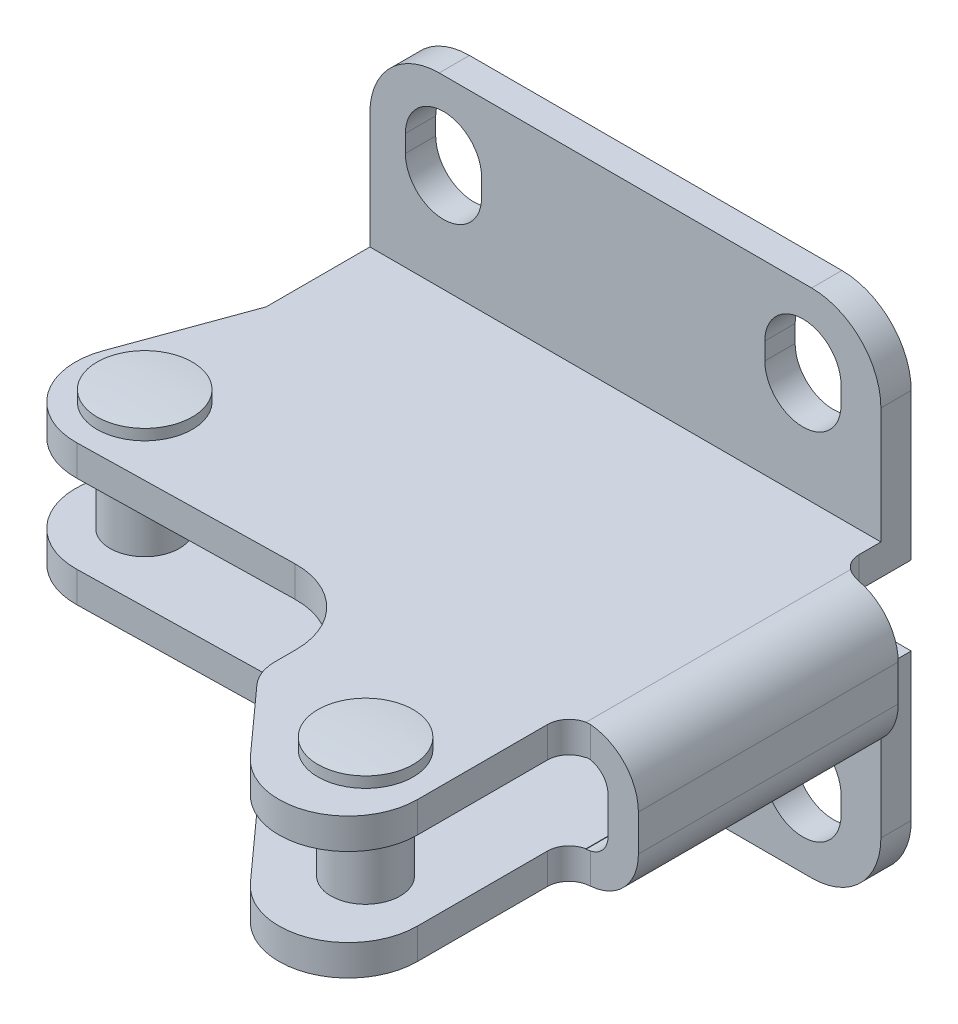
ISO-10303-21;
HEADER;
FILE_DESCRIPTION(('STEP AP214'),'2;1');
FILE_NAME('part.step','',(''),(''),'','','');
FILE_SCHEMA(('AUTOMOTIVE_DESIGN { 1 0 10303 214 1 1 1 1 }'));
ENDSEC;
DATA;
#1=APPLICATION_CONTEXT('core data for automotive mechanical design processes');
#2=APPLICATION_PROTOCOL_DEFINITION('international standard','automotive_design',2000,#1);
#3=PRODUCT_CONTEXT('',#1,'mechanical');
#4=PRODUCT('Part','Part','',(#3));
#5=PRODUCT_RELATED_PRODUCT_CATEGORY('part','',(#4));
#6=PRODUCT_DEFINITION_FORMATION('','',#4);
#7=PRODUCT_DEFINITION_CONTEXT('part definition',#1,'design');
#8=PRODUCT_DEFINITION('design','',#6,#7);
#9=PRODUCT_DEFINITION_SHAPE('','',#8);
#10=(LENGTH_UNIT() NAMED_UNIT(*) SI_UNIT(.MILLI.,.METRE.));
#11=(NAMED_UNIT(*) PLANE_ANGLE_UNIT() SI_UNIT($,.RADIAN.));
#12=(NAMED_UNIT(*) SI_UNIT($,.STERADIAN.) SOLID_ANGLE_UNIT());
#13=UNCERTAINTY_MEASURE_WITH_UNIT(LENGTH_MEASURE(1.E-05),#10,'distance_accuracy_value','');
#14=(GEOMETRIC_REPRESENTATION_CONTEXT(3) GLOBAL_UNCERTAINTY_ASSIGNED_CONTEXT((#13)) GLOBAL_UNIT_ASSIGNED_CONTEXT((#10,
#11,#12)) REPRESENTATION_CONTEXT('',''));
#15=CARTESIAN_POINT('',(0.,0.,0.));
#16=DIRECTION('',(0.,0.,1.));
#17=DIRECTION('',(1.,0.,0.));
#18=AXIS2_PLACEMENT_3D('',#15,#16,#17);
#19=CARTESIAN_POINT('',(41.5,15.9877132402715,54.));
#20=DIRECTION('',(0.,1.,0.));
#21=DIRECTION('',(0.,0.,1.));
#22=AXIS2_PLACEMENT_3D('',#19,#20,#21);
#23=CYLINDRICAL_SURFACE('',#22,4.);
#24=CARTESIAN_POINT('',(41.5,26.05,54.));
#25=DIRECTION('',(0.,-1.,0.));
#26=DIRECTION('',(0.,0.,1.));
#27=AXIS2_PLACEMENT_3D('',#24,#25,#26);
#28=CIRCLE('',#27,4.);
#29=CARTESIAN_POINT('',(41.5,26.05,58.));
#30=VERTEX_POINT('',#29);
#31=EDGE_CURVE('E9',#30,#30,#28,.F.);
#32=ORIENTED_EDGE('',*,*,#31,.F.);
#33=EDGE_LOOP('',(#32));
#34=FACE_BOUND('',#33,.T.);
#35=CARTESIAN_POINT('',(41.5,16.95,54.));
#36=DIRECTION('',(0.,1.,0.));
#37=DIRECTION('',(0.,0.,-1.));
#38=AXIS2_PLACEMENT_3D('',#35,#36,#37);
#39=CIRCLE('',#38,4.);
#40=CARTESIAN_POINT('',(41.5,16.95,50.));
#41=VERTEX_POINT('',#40);
#42=EDGE_CURVE('E794',#41,#41,#39,.F.);
#43=ORIENTED_EDGE('',*,*,#42,.F.);
#44=EDGE_LOOP('',(#43));
#45=FACE_BOUND('',#44,.T.);
#46=ADVANCED_FACE('F14',(#34,#45),#23,.T.);
#47=CARTESIAN_POINT('',(41.5,14.4,54.));
#48=DIRECTION('',(0.,-1.,0.));
#49=DIRECTION('',(0.,0.,-1.));
#50=AXIS2_PLACEMENT_3D('',#47,#48,#49);
#51=CONICAL_SURFACE('',#50,2.75,1.04719755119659);
#52=CARTESIAN_POINT('',(41.5,15.9877132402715,54.));
#53=VERTEX_POINT('',#52);
#54=VERTEX_LOOP('',#53);
#55=FACE_BOUND('',#54,.T.);
#56=CARTESIAN_POINT('',(41.5,14.4,54.));
#57=DIRECTION('',(0.,1.,0.));
#58=DIRECTION('',(0.,0.,1.));
#59=AXIS2_PLACEMENT_3D('',#56,#57,#58);
#60=CIRCLE('',#59,2.75);
#61=CARTESIAN_POINT('',(41.5,14.4,56.75));
#62=VERTEX_POINT('',#61);
#63=EDGE_CURVE('E826',#62,#62,#60,.T.);
#64=ORIENTED_EDGE('',*,*,#63,.F.);
#65=EDGE_LOOP('',(#64));
#66=FACE_BOUND('',#65,.T.);
#67=ADVANCED_FACE('F928',(#55,#66),#51,.F.);
#68=CARTESIAN_POINT('',(41.5,15.9877132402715,54.));
#69=DIRECTION('',(0.,1.,0.));
#70=DIRECTION('',(0.,0.,1.));
#71=AXIS2_PLACEMENT_3D('',#68,#69,#70);
#72=CYLINDRICAL_SURFACE('',#71,2.75);
#73=ORIENTED_EDGE('',*,*,#63,.T.);
#74=EDGE_LOOP('',(#73));
#75=FACE_BOUND('',#74,.T.);
#76=CARTESIAN_POINT('',(41.5,11.9630539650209,54.));
#77=DIRECTION('',(0.,1.,0.));
#78=DIRECTION('',(0.,0.,1.));
#79=AXIS2_PLACEMENT_3D('',#76,#77,#78);
#80=CIRCLE('',#79,2.75000000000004);
#81=CARTESIAN_POINT('',(41.5,11.9630539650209,51.2500000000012));
#82=VERTEX_POINT('',#81);
#83=EDGE_CURVE('E1049',#82,#82,#80,.T.);
#84=ORIENTED_EDGE('',*,*,#83,.F.);
#85=EDGE_LOOP('',(#84));
#86=FACE_BOUND('',#85,.T.);
#87=ADVANCED_FACE('F936',(#75,#86),#72,.F.);
#88=CARTESIAN_POINT('',(41.5,71.9000000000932,54.0000000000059));
#89=DIRECTION('',(0.,1.,0.));
#90=DIRECTION('',(0.,0.,-1.));
#91=AXIS2_PLACEMENT_3D('',#88,#89,#90);
#92=SPHERICAL_SURFACE('',#91,60.0000000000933);
#93=CARTESIAN_POINT('',(41.5,12.1526151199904,54.));
#94=DIRECTION('',(0.,1.,0.));
#95=DIRECTION('',(0.,0.,1.));
#96=AXIS2_PLACEMENT_3D('',#93,#94,#95);
#97=CIRCLE('',#96,5.5);
#98=CARTESIAN_POINT('',(41.5,12.1526151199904,48.5000000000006));
#99=VERTEX_POINT('',#98);
#100=EDGE_CURVE('E1052',#99,#99,#97,.T.);
#101=CARTESIAN_POINT('',(41.5,11.9630539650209,51.2500000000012));
#102=CARTESIAN_POINT('',(41.5,11.9643701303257,51.2213138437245));
#103=CARTESIAN_POINT('',(41.5,11.9657068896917,51.1926286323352));
#104=CARTESIAN_POINT('',(41.5,11.9684215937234,51.1352601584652));
#105=CARTESIAN_POINT('',(41.5,11.9697995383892,51.1065768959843));
#106=CARTESIAN_POINT('',(41.5,11.9725966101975,51.0492123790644));
#107=CARTESIAN_POINT('',(41.5,11.9740157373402,51.0205311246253));
#108=CARTESIAN_POINT('',(41.5,11.976895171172,50.963170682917));
#109=CARTESIAN_POINT('',(41.5,11.9783554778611,50.9344914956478));
#110=CARTESIAN_POINT('',(41.5,11.9813172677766,50.8771352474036));
#111=CARTESIAN_POINT('',(41.5,11.982818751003,50.8484581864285));
#112=CARTESIAN_POINT('',(41.5,11.9858628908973,50.7911062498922));
#113=CARTESIAN_POINT('',(41.5,11.9874055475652,50.762431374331));
#114=CARTESIAN_POINT('',(41.5,11.9905320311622,50.7050838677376));
#115=CARTESIAN_POINT('',(41.5,11.9921158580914,50.6764112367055));
#116=CARTESIAN_POINT('',(41.5,11.9953246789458,50.6190682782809));
#117=CARTESIAN_POINT('',(41.5,11.9969496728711,50.5903979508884));
#118=CARTESIAN_POINT('',(41.5,12.0002408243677,50.5330596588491));
#119=CARTESIAN_POINT('',(41.5,12.0019069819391,50.5043916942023));
#120=CARTESIAN_POINT('',(41.5,12.0052804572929,50.4470581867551));
#121=CARTESIAN_POINT('',(41.5,12.0069877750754,50.4183926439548));
#122=CARTESIAN_POINT('',(41.5,12.0104435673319,50.3610640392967));
#123=CARTESIAN_POINT('',(41.5,12.0121920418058,50.332400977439));
#124=CARTESIAN_POINT('',(41.5,12.0157301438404,50.2750773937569));
#125=CARTESIAN_POINT('',(41.5,12.0175197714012,50.2464168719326));
#126=CARTESIAN_POINT('',(41.5,12.02114017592,50.1890984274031));
#127=CARTESIAN_POINT('',(41.5,12.0229709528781,50.1604405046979));
#128=CARTESIAN_POINT('',(41.5,12.0266736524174,50.103127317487));
#129=CARTESIAN_POINT('',(41.5,12.0285455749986,50.0744720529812));
#130=CARTESIAN_POINT('',(41.5,12.032330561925,50.0171642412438));
#131=CARTESIAN_POINT('',(41.5,12.0342436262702,49.9885116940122));
#132=CARTESIAN_POINT('',(41.5,12.0381108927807,49.9312093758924));
#133=CARTESIAN_POINT('',(41.5,12.040065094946,49.9025596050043));
#134=CARTESIAN_POINT('',(41.5,12.044014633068,49.8452628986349));
#135=CARTESIAN_POINT('',(41.5,12.0460099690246,49.8166159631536));
#136=CARTESIAN_POINT('',(41.5,12.0500417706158,49.7593249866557));
#137=CARTESIAN_POINT('',(41.5,12.0520782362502,49.730680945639));
#138=CARTESIAN_POINT('',(41.5,12.0561922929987,49.6733958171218));
#139=CARTESIAN_POINT('',(41.5,12.0582698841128,49.6447547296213));
#140=CARTESIAN_POINT('',(41.5,12.0624661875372,49.5874755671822));
#141=CARTESIAN_POINT('',(41.5,12.0645848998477,49.5588374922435));
#142=CARTESIAN_POINT('',(41.5,12.0688634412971,49.5015644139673));
#143=CARTESIAN_POINT('',(41.5,12.0710232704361,49.4729294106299));
#144=CARTESIAN_POINT('',(41.5,12.07538404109,49.4156625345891));
#145=CARTESIAN_POINT('',(41.5,12.0775849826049,49.3870306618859));
#146=CARTESIAN_POINT('',(41.5,12.0820279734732,49.3297701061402));
#147=CARTESIAN_POINT('',(41.5,12.0842700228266,49.3011414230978));
#148=CARTESIAN_POINT('',(41.5,12.0887952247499,49.2438873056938));
#149=CARTESIAN_POINT('',(41.5,12.0910783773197,49.2152618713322));
#150=CARTESIAN_POINT('',(41.5,12.0956857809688,49.1580143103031));
#151=CARTESIAN_POINT('',(41.5,12.0980100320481,49.1293921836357));
#152=CARTESIAN_POINT('',(41.5,12.1026996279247,49.0721512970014));
#153=CARTESIAN_POINT('',(41.5,12.1050649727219,49.0435325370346));
#154=CARTESIAN_POINT('',(41.5,12.1098367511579,48.9862984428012));
#155=CARTESIAN_POINT('',(41.5,12.1122431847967,48.9576831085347));
#156=CARTESIAN_POINT('',(41.5,12.1170971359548,48.9004559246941));
#157=CARTESIAN_POINT('',(41.5,12.1195446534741,48.8718440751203));
#158=CARTESIAN_POINT('',(41.5,12.1244807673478,48.8146239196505));
#159=CARTESIAN_POINT('',(41.5,12.1269693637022,48.7860156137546));
#160=CARTESIAN_POINT('',(41.5,12.1319876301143,48.7288026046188));
#161=CARTESIAN_POINT('',(41.5,12.1345173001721,48.7001979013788));
#162=CARTESIAN_POINT('',(41.5,12.1396177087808,48.6429921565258));
#163=CARTESIAN_POINT('',(41.5,12.1421884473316,48.6143911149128));
#164=CARTESIAN_POINT('',(41.5,12.1473709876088,48.5571927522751));
#165=CARTESIAN_POINT('',(41.5,12.1499827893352,48.5285954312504));
#166=CARTESIAN_POINT('',(41.5,12.1526151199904,48.5000000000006));
#167=B_SPLINE_CURVE_WITH_KNOTS('',3,(#101,#102,#103,#104,#105,#106,#107,#108,#109,#110,#111,
#112,#113,#114,#115,#116,#117,#118,#119,#120,#121,#122,#123,#124,#125,#126,#127,#128,#129,#130,
#131,#132,#133,#134,#135,#136,#137,#138,#139,#140,#141,#142,#143,#144,#145,#146,#147,#148,#149,
#150,#151,#152,#153,#154,#155,#156,#157,#158,#159,#160,#161,#162,#163,#164,#165,#166),
.UNSPECIFIED.,.F.,.F.,(4,2,2,2,2,2,2,2,2,2,2,2,2,2,2,2,2,2,2,2,2,2,2,2,2,2,2,2,2,2,2,2,4),(0.,
0.0861489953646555,0.172297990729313,0.258446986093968,0.34459598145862,0.430744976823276,
0.516893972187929,0.603042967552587,0.689191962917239,0.775340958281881,0.861489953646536,
0.947638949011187,1.03378794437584,1.1199369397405,1.20608593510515,1.29223493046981,
1.37838392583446,1.46453292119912,1.55068191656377,1.63683091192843,1.72297990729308,
1.80912890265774,1.89527789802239,1.98142689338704,2.06757588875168,2.15372488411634,
2.23987387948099,2.32602287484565,2.4121718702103,2.49832086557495,2.58446986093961,
2.67061885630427,2.75676785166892),.UNSPECIFIED.);
#168=EDGE_CURVE('BSEAM932',#82,#99,#167,.T.);
#169=ORIENTED_EDGE('',*,*,#83,.T.);
#170=ORIENTED_EDGE('',*,*,#100,.F.);
#171=ORIENTED_EDGE('',*,*,#168,.T.);
#172=ORIENTED_EDGE('',*,*,#168,.F.);
#173=EDGE_LOOP('',(#169,#171,#170,#172));
#174=FACE_BOUND('',#173,.T.);
#175=ADVANCED_FACE('F932',(#174),#92,.T.);
#176=CARTESIAN_POINT('',(41.5,15.9877132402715,54.));
#177=DIRECTION('',(0.,1.,0.));
#178=DIRECTION('',(0.,0.,1.));
#179=AXIS2_PLACEMENT_3D('',#176,#177,#178);
#180=CYLINDRICAL_SURFACE('',#179,5.5);
#181=ORIENTED_EDGE('',*,*,#100,.T.);
#182=EDGE_LOOP('',(#181));
#183=FACE_BOUND('',#182,.T.);
#184=CARTESIAN_POINT('',(41.5,13.4,54.));
#185=DIRECTION('',(0.,1.,0.));
#186=DIRECTION('',(0.,0.,1.));
#187=AXIS2_PLACEMENT_3D('',#184,#185,#186);
#188=CIRCLE('',#187,5.5);
#189=CARTESIAN_POINT('',(41.5,13.4,59.5));
#190=VERTEX_POINT('',#189);
#191=EDGE_CURVE('E806',#190,#190,#188,.T.);
#192=ORIENTED_EDGE('',*,*,#191,.F.);
#193=EDGE_LOOP('',(#192));
#194=FACE_BOUND('',#193,.T.);
#195=ADVANCED_FACE('F922',(#183,#194),#180,.T.);
#196=CARTESIAN_POINT('',(41.5,-28.8999999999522,53.9999999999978));
#197=DIRECTION('',(0.,1.,0.));
#198=DIRECTION('',(0.,0.,1.));
#199=AXIS2_PLACEMENT_3D('',#196,#197,#198);
#200=SPHERICAL_SURFACE('',#199,59.9999999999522);
#201=CARTESIAN_POINT('',(41.5,30.8473848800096,54.));
#202=DIRECTION('',(0.,1.,0.));
#203=DIRECTION('',(0.,0.,1.));
#204=AXIS2_PLACEMENT_3D('',#201,#202,#203);
#205=CIRCLE('',#204,5.5);
#206=CARTESIAN_POINT('',(41.5,30.8473848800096,59.5));
#207=VERTEX_POINT('',#206);
#208=EDGE_CURVE('E795',#207,#207,#205,.T.);
#209=ORIENTED_EDGE('',*,*,#208,.T.);
#210=EDGE_LOOP('',(#209));
#211=FACE_BOUND('',#210,.T.);
#212=ADVANCED_FACE('F919',(#211),#200,.T.);
#213=CARTESIAN_POINT('',(41.5,15.9877132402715,54.));
#214=DIRECTION('',(0.,1.,0.));
#215=DIRECTION('',(0.,0.,1.));
#216=AXIS2_PLACEMENT_3D('',#213,#214,#215);
#217=CYLINDRICAL_SURFACE('',#216,5.5);
#218=CARTESIAN_POINT('',(41.5,29.6,54.));
#219=DIRECTION('',(0.,1.,0.));
#220=DIRECTION('',(0.,0.,1.));
#221=AXIS2_PLACEMENT_3D('',#218,#219,#220);
#222=CIRCLE('',#221,5.5);
#223=CARTESIAN_POINT('',(41.5,29.6,59.5));
#224=VERTEX_POINT('',#223);
#225=EDGE_CURVE('E801',#224,#224,#222,.T.);
#226=ORIENTED_EDGE('',*,*,#225,.T.);
#227=EDGE_LOOP('',(#226));
#228=FACE_BOUND('',#227,.T.);
#229=ORIENTED_EDGE('',*,*,#208,.F.);
#230=EDGE_LOOP('',(#229));
#231=FACE_BOUND('',#230,.T.);
#232=ADVANCED_FACE('F917',(#228,#231),#217,.T.);
#233=CARTESIAN_POINT('',(-6.,14.4,32.));
#234=DIRECTION('',(0.,-1.,0.));
#235=DIRECTION('',(0.,0.,-1.));
#236=AXIS2_PLACEMENT_3D('',#233,#234,#235);
#237=CONICAL_SURFACE('',#236,2.75,1.04719755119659);
#238=CARTESIAN_POINT('',(-6.,15.9877132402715,32.));
#239=VERTEX_POINT('',#238);
#240=VERTEX_LOOP('',#239);
#241=FACE_BOUND('',#240,.T.);
#242=CARTESIAN_POINT('',(-6.,14.4,32.));
#243=DIRECTION('',(0.,1.,0.));
#244=DIRECTION('',(0.,0.,1.));
#245=AXIS2_PLACEMENT_3D('',#242,#243,#244);
#246=CIRCLE('',#245,2.75);
#247=CARTESIAN_POINT('',(-6.,14.4,34.75));
#248=VERTEX_POINT('',#247);
#249=EDGE_CURVE('E791',#248,#248,#246,.T.);
#250=ORIENTED_EDGE('',*,*,#249,.F.);
#251=EDGE_LOOP('',(#250));
#252=FACE_BOUND('',#251,.T.);
#253=ADVANCED_FACE('F864',(#241,#252),#237,.F.);
#254=CARTESIAN_POINT('',(-6.,15.9877132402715,32.));
#255=DIRECTION('',(0.,1.,0.));
#256=DIRECTION('',(0.,0.,1.));
#257=AXIS2_PLACEMENT_3D('',#254,#255,#256);
#258=CYLINDRICAL_SURFACE('',#257,2.75);
#259=ORIENTED_EDGE('',*,*,#249,.T.);
#260=EDGE_LOOP('',(#259));
#261=FACE_BOUND('',#260,.T.);
#262=CARTESIAN_POINT('',(-6.,11.9630539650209,32.));
#263=DIRECTION('',(0.,1.,0.));
#264=DIRECTION('',(0.,0.,1.));
#265=AXIS2_PLACEMENT_3D('',#262,#263,#264);
#266=CIRCLE('',#265,2.75000000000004);
#267=CARTESIAN_POINT('',(-6.,11.9630539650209,29.2500000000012));
#268=VERTEX_POINT('',#267);
#269=EDGE_CURVE('E812',#268,#268,#266,.T.);
#270=ORIENTED_EDGE('',*,*,#269,.F.);
#271=EDGE_LOOP('',(#270));
#272=FACE_BOUND('',#271,.T.);
#273=ADVANCED_FACE('F849',(#261,#272),#258,.F.);
#274=CARTESIAN_POINT('',(-6.,-28.8999999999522,31.9999999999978));
#275=DIRECTION('',(0.,1.,0.));
#276=DIRECTION('',(0.,0.,1.));
#277=AXIS2_PLACEMENT_3D('',#274,#275,#276);
#278=SPHERICAL_SURFACE('',#277,59.9999999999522);
#279=CARTESIAN_POINT('',(-6.,30.8473848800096,32.));
#280=DIRECTION('',(0.,1.,0.));
#281=DIRECTION('',(0.,0.,1.));
#282=AXIS2_PLACEMENT_3D('',#279,#280,#281);
#283=CIRCLE('',#282,5.5);
#284=CARTESIAN_POINT('',(-6.,30.8473848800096,37.5));
#285=VERTEX_POINT('',#284);
#286=EDGE_CURVE('E824',#285,#285,#283,.T.);
#287=ORIENTED_EDGE('',*,*,#286,.T.);
#288=EDGE_LOOP('',(#287));
#289=FACE_BOUND('',#288,.T.);
#290=ADVANCED_FACE('F869',(#289),#278,.T.);
#291=CARTESIAN_POINT('',(37.1,43.,3.5));
#292=DIRECTION('',(1.,0.,0.));
#293=DIRECTION('',(0.,1.,0.));
#294=AXIS2_PLACEMENT_3D('',#291,#292,#293);
#295=PLANE('',#294);
#296=DIRECTION('',(0.,-1.,0.));
#297=VECTOR('',#296,1.);
#298=CARTESIAN_POINT('',(37.1,43.,0.));
#299=LINE('',#298,#297);
#300=CARTESIAN_POINT('',(37.1,43.,0.));
#301=VERTEX_POINT('',#300);
#302=CARTESIAN_POINT('',(37.1,41.,0.));
#303=VERTEX_POINT('',#302);
#304=EDGE_CURVE('E347',#301,#303,#299,.T.);
#305=ORIENTED_EDGE('',*,*,#304,.F.);
#306=DIRECTION('',(0.,0.,-1.));
#307=VECTOR('',#306,1.);
#308=CARTESIAN_POINT('',(37.1,43.,3.5));
#309=LINE('',#308,#307);
#310=CARTESIAN_POINT('',(37.1,43.,3.5));
#311=VERTEX_POINT('',#310);
#312=EDGE_CURVE('E365',#311,#301,#309,.T.);
#313=ORIENTED_EDGE('',*,*,#312,.F.);
#314=DIRECTION('',(0.,-1.,0.));
#315=VECTOR('',#314,1.);
#316=CARTESIAN_POINT('',(37.1,43.,3.5));
#317=LINE('',#316,#315);
#318=CARTESIAN_POINT('',(37.1,41.,3.5));
#319=VERTEX_POINT('',#318);
#320=EDGE_CURVE('E361',#311,#319,#317,.T.);
#321=ORIENTED_EDGE('',*,*,#320,.T.);
#322=DIRECTION('',(0.,0.,-1.));
#323=VECTOR('',#322,1.);
#324=CARTESIAN_POINT('',(37.1,41.,3.5));
#325=LINE('',#324,#323);
#326=EDGE_CURVE('E318',#319,#303,#325,.T.);
#327=ORIENTED_EDGE('',*,*,#326,.T.);
#328=EDGE_LOOP('',(#305,#313,#321,#327));
#329=FACE_BOUND('',#328,.T.);
#330=ADVANCED_FACE('F835',(#329),#295,.T.);
#331=CARTESIAN_POINT('',(41.5,43.,3.5));
#332=DIRECTION('',(0.,0.,-1.));
#333=DIRECTION('',(0.,-1.,0.));
#334=AXIS2_PLACEMENT_3D('',#331,#332,#333);
#335=CYLINDRICAL_SURFACE('',#334,4.4);
#336=CARTESIAN_POINT('',(41.5,43.,0.));
#337=DIRECTION('',(0.,0.,1.));
#338=DIRECTION('',(1.,0.,0.));
#339=AXIS2_PLACEMENT_3D('',#336,#337,#338);
#340=CIRCLE('',#339,4.4);
#341=CARTESIAN_POINT('',(45.9,43.,0.));
#342=VERTEX_POINT('',#341);
#343=EDGE_CURVE('E336',#342,#301,#340,.T.);
#344=ORIENTED_EDGE('',*,*,#343,.F.);
#345=DIRECTION('',(0.,0.,-1.));
#346=VECTOR('',#345,1.);
#347=CARTESIAN_POINT('',(45.9,43.,3.5));
#348=LINE('',#347,#346);
#349=CARTESIAN_POINT('',(45.9,43.,3.5));
#350=VERTEX_POINT('',#349);
#351=EDGE_CURVE('E331',#350,#342,#348,.T.);
#352=ORIENTED_EDGE('',*,*,#351,.F.);
#353=CARTESIAN_POINT('',(41.5,43.,3.5));
#354=DIRECTION('',(0.,0.,1.));
#355=DIRECTION('',(1.,0.,0.));
#356=AXIS2_PLACEMENT_3D('',#353,#354,#355);
#357=CIRCLE('',#356,4.4);
#358=EDGE_CURVE('E355',#350,#311,#357,.T.);
#359=ORIENTED_EDGE('',*,*,#358,.T.);
#360=ORIENTED_EDGE('',*,*,#312,.T.);
#361=EDGE_LOOP('',(#344,#352,#359,#360));
#362=FACE_BOUND('',#361,.T.);
#363=ADVANCED_FACE('F830',(#362),#335,.F.);
#364=CARTESIAN_POINT('',(45.9,41.,3.5));
#365=DIRECTION('',(-1.,0.,0.));
#366=DIRECTION('',(0.,-1.,0.));
#367=AXIS2_PLACEMENT_3D('',#364,#365,#366);
#368=PLANE('',#367);
#369=DIRECTION('',(0.,1.,0.));
#370=VECTOR('',#369,1.);
#371=CARTESIAN_POINT('',(45.9,41.,0.));
#372=LINE('',#371,#370);
#373=CARTESIAN_POINT('',(45.9,41.,0.));
#374=VERTEX_POINT('',#373);
#375=EDGE_CURVE('E325',#374,#342,#372,.T.);
#376=ORIENTED_EDGE('',*,*,#375,.F.);
#377=DIRECTION('',(0.,0.,-1.));
#378=VECTOR('',#377,1.);
#379=CARTESIAN_POINT('',(45.9,41.,3.5));
#380=LINE('',#379,#378);
#381=CARTESIAN_POINT('',(45.9,41.,3.5));
#382=VERTEX_POINT('',#381);
#383=EDGE_CURVE('E328',#382,#374,#380,.T.);
#384=ORIENTED_EDGE('',*,*,#383,.F.);
#385=DIRECTION('',(0.,1.,0.));
#386=VECTOR('',#385,1.);
#387=CARTESIAN_POINT('',(45.9,41.,3.5));
#388=LINE('',#387,#386);
#389=EDGE_CURVE('E349',#382,#350,#388,.T.);
#390=ORIENTED_EDGE('',*,*,#389,.T.);
#391=ORIENTED_EDGE('',*,*,#351,.T.);
#392=EDGE_LOOP('',(#376,#384,#390,#391));
#393=FACE_BOUND('',#392,.T.);
#394=ADVANCED_FACE('F327',(#393),#368,.T.);
#395=CARTESIAN_POINT('',(41.5,41.,3.5));
#396=DIRECTION('',(0.,0.,-1.));
#397=DIRECTION('',(0.,-1.,0.));
#398=AXIS2_PLACEMENT_3D('',#395,#396,#397);
#399=CYLINDRICAL_SURFACE('',#398,4.4);
#400=CARTESIAN_POINT('',(41.5,41.,0.));
#401=DIRECTION('',(0.,0.,1.));
#402=DIRECTION('',(-1.,0.,0.));
#403=AXIS2_PLACEMENT_3D('',#400,#401,#402);
#404=CIRCLE('',#403,4.4);
#405=EDGE_CURVE('E340',#303,#374,#404,.T.);
#406=ORIENTED_EDGE('',*,*,#405,.F.);
#407=ORIENTED_EDGE('',*,*,#326,.F.);
#408=CARTESIAN_POINT('',(41.5,41.,3.5));
#409=DIRECTION('',(0.,0.,1.));
#410=DIRECTION('',(-1.,0.,0.));
#411=AXIS2_PLACEMENT_3D('',#408,#409,#410);
#412=CIRCLE('',#411,4.4);
#413=EDGE_CURVE('E343',#319,#382,#412,.T.);
#414=ORIENTED_EDGE('',*,*,#413,.T.);
#415=ORIENTED_EDGE('',*,*,#383,.T.);
#416=EDGE_LOOP('',(#406,#407,#414,#415));
#417=FACE_BOUND('',#416,.T.);
#418=ADVANCED_FACE('F339',(#417),#399,.F.);
#419=CARTESIAN_POINT('',(42.4999999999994,42.9999999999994,3.5));
#420=DIRECTION('',(0.,0.,-1.));
#421=DIRECTION('',(0.,-1.,0.));
#422=AXIS2_PLACEMENT_3D('',#419,#420,#421);
#423=CYLINDRICAL_SURFACE('',#422,8.00000000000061);
#424=CARTESIAN_POINT('',(42.4999999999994,42.9999999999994,0.));
#425=DIRECTION('',(0.,0.,1.));
#426=DIRECTION('',(-1.,0.,0.));
#427=AXIS2_PLACEMENT_3D('',#424,#425,#426);
#428=CIRCLE('',#427,8.00000000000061);
#429=CARTESIAN_POINT('',(50.5,43.,0.));
#430=VERTEX_POINT('',#429);
#431=CARTESIAN_POINT('',(42.5,51.,0.));
#432=VERTEX_POINT('',#431);
#433=EDGE_CURVE('E576',#430,#432,#428,.T.);
#434=ORIENTED_EDGE('',*,*,#433,.T.);
#435=DIRECTION('',(0.,0.,-1.));
#436=VECTOR('',#435,1.);
#437=CARTESIAN_POINT('',(42.5,51.,3.5));
#438=LINE('',#437,#436);
#439=CARTESIAN_POINT('',(42.5,51.,3.5));
#440=VERTEX_POINT('',#439);
#441=EDGE_CURVE('E633',#440,#432,#438,.T.);
#442=ORIENTED_EDGE('',*,*,#441,.F.);
#443=CARTESIAN_POINT('',(42.4999999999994,42.9999999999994,3.5));
#444=DIRECTION('',(0.,0.,1.));
#445=DIRECTION('',(-1.,0.,0.));
#446=AXIS2_PLACEMENT_3D('',#443,#444,#445);
#447=CIRCLE('',#446,8.00000000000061);
#448=CARTESIAN_POINT('',(50.5,43.,3.5));
#449=VERTEX_POINT('',#448);
#450=EDGE_CURVE('E597',#449,#440,#447,.T.);
#451=ORIENTED_EDGE('',*,*,#450,.F.);
#452=DIRECTION('',(0.,0.,-1.));
#453=VECTOR('',#452,1.);
#454=CARTESIAN_POINT('',(50.5,43.,3.5));
#455=LINE('',#454,#453);
#456=EDGE_CURVE('E636',#449,#430,#455,.T.);
#457=ORIENTED_EDGE('',*,*,#456,.T.);
#458=EDGE_LOOP('',(#434,#442,#451,#457));
#459=FACE_BOUND('',#458,.T.);
#460=ADVANCED_FACE('F1357',(#459),#423,.T.);
#461=CARTESIAN_POINT('',(42.5,51.,3.5));
#462=DIRECTION('',(0.,-1.,0.));
#463=DIRECTION('',(1.,0.,0.));
#464=AXIS2_PLACEMENT_3D('',#461,#462,#463);
#465=PLANE('',#464);
#466=DIRECTION('',(-1.,0.,0.));
#467=VECTOR('',#466,1.);
#468=CARTESIAN_POINT('',(42.5,51.,0.));
#469=LINE('',#468,#467);
#470=CARTESIAN_POINT('',(-0.499999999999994,51.,0.));
#471=VERTEX_POINT('',#470);
#472=EDGE_CURVE('E579',#432,#471,#469,.T.);
#473=ORIENTED_EDGE('',*,*,#472,.T.);
#474=DIRECTION('',(0.,0.,-1.));
#475=VECTOR('',#474,1.);
#476=CARTESIAN_POINT('',(-0.499999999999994,51.,3.5));
#477=LINE('',#476,#475);
#478=CARTESIAN_POINT('',(-0.499999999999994,51.,3.5));
#479=VERTEX_POINT('',#478);
#480=EDGE_CURVE('E630',#479,#471,#477,.T.);
#481=ORIENTED_EDGE('',*,*,#480,.F.);
#482=DIRECTION('',(-1.,0.,0.));
#483=VECTOR('',#482,1.);
#484=CARTESIAN_POINT('',(42.5,51.,3.5));
#485=LINE('',#484,#483);
#486=EDGE_CURVE('E599',#440,#479,#485,.T.);
#487=ORIENTED_EDGE('',*,*,#486,.F.);
#488=ORIENTED_EDGE('',*,*,#441,.T.);
#489=EDGE_LOOP('',(#473,#481,#487,#488));
#490=FACE_BOUND('',#489,.T.);
#491=ADVANCED_FACE('F1344',(#490),#465,.F.);
#492=CARTESIAN_POINT('',(-4.4,43.,3.5));
#493=DIRECTION('',(1.,0.,0.));
#494=DIRECTION('',(0.,1.,0.));
#495=AXIS2_PLACEMENT_3D('',#492,#493,#494);
#496=PLANE('',#495);
#497=DIRECTION('',(0.,-1.,0.));
#498=VECTOR('',#497,1.);
#499=CARTESIAN_POINT('',(-4.4,43.,0.));
#500=LINE('',#499,#498);
#501=CARTESIAN_POINT('',(-4.4,43.,0.));
#502=VERTEX_POINT('',#501);
#503=CARTESIAN_POINT('',(-4.4,41.,0.));
#504=VERTEX_POINT('',#503);
#505=EDGE_CURVE('E373',#502,#504,#500,.T.);
#506=ORIENTED_EDGE('',*,*,#505,.F.);
#507=DIRECTION('',(0.,0.,-1.));
#508=VECTOR('',#507,1.);
#509=CARTESIAN_POINT('',(-4.4,43.,3.5));
#510=LINE('',#509,#508);
#511=CARTESIAN_POINT('',(-4.4,43.,3.5));
#512=VERTEX_POINT('',#511);
#513=EDGE_CURVE('E397',#512,#502,#510,.T.);
#514=ORIENTED_EDGE('',*,*,#513,.F.);
#515=DIRECTION('',(0.,-1.,0.));
#516=VECTOR('',#515,1.);
#517=CARTESIAN_POINT('',(-4.4,43.,3.5));
#518=LINE('',#517,#516);
#519=CARTESIAN_POINT('',(-4.4,41.,3.5));
#520=VERTEX_POINT('',#519);
#521=EDGE_CURVE('E386',#512,#520,#518,.T.);
#522=ORIENTED_EDGE('',*,*,#521,.T.);
#523=DIRECTION('',(0.,0.,-1.));
#524=VECTOR('',#523,1.);
#525=CARTESIAN_POINT('',(-4.4,41.,3.5));
#526=LINE('',#525,#524);
#527=EDGE_CURVE('E395',#520,#504,#526,.T.);
#528=ORIENTED_EDGE('',*,*,#527,.T.);
#529=EDGE_LOOP('',(#506,#514,#522,#528));
#530=FACE_BOUND('',#529,.T.);
#531=ADVANCED_FACE('F1354',(#530),#496,.T.);
#532=CARTESIAN_POINT('',(0.,43.,3.5));
#533=DIRECTION('',(0.,0.,-1.));
#534=DIRECTION('',(0.,-1.,0.));
#535=AXIS2_PLACEMENT_3D('',#532,#533,#534);
#536=CYLINDRICAL_SURFACE('',#535,4.4);
#537=CARTESIAN_POINT('',(0.,43.,0.));
#538=DIRECTION('',(0.,0.,1.));
#539=DIRECTION('',(1.,0.,0.));
#540=AXIS2_PLACEMENT_3D('',#537,#538,#539);
#541=CIRCLE('',#540,4.4);
#542=CARTESIAN_POINT('',(4.4,43.,0.));
#543=VERTEX_POINT('',#542);
#544=EDGE_CURVE('E369',#543,#502,#541,.T.);
#545=ORIENTED_EDGE('',*,*,#544,.F.);
#546=DIRECTION('',(0.,0.,-1.));
#547=VECTOR('',#546,1.);
#548=CARTESIAN_POINT('',(4.4,43.,3.5));
#549=LINE('',#548,#547);
#550=CARTESIAN_POINT('',(4.4,43.,3.5));
#551=VERTEX_POINT('',#550);
#552=EDGE_CURVE('E399',#551,#543,#549,.T.);
#553=ORIENTED_EDGE('',*,*,#552,.F.);
#554=CARTESIAN_POINT('',(0.,43.,3.5));
#555=DIRECTION('',(0.,0.,1.));
#556=DIRECTION('',(1.,0.,0.));
#557=AXIS2_PLACEMENT_3D('',#554,#555,#556);
#558=CIRCLE('',#557,4.4);
#559=EDGE_CURVE('E384',#551,#512,#558,.T.);
#560=ORIENTED_EDGE('',*,*,#559,.T.);
#561=ORIENTED_EDGE('',*,*,#513,.T.);
#562=EDGE_LOOP('',(#545,#553,#560,#561));
#563=FACE_BOUND('',#562,.T.);
#564=ADVANCED_FACE('F1364',(#563),#536,.F.);
#565=CARTESIAN_POINT('',(4.4,41.,3.5));
#566=DIRECTION('',(-1.,0.,0.));
#567=DIRECTION('',(0.,-1.,0.));
#568=AXIS2_PLACEMENT_3D('',#565,#566,#567);
#569=PLANE('',#568);
#570=DIRECTION('',(0.,1.,0.));
#571=VECTOR('',#570,1.);
#572=CARTESIAN_POINT('',(4.4,41.,0.));
#573=LINE('',#572,#571);
#574=CARTESIAN_POINT('',(4.4,41.,0.));
#575=VERTEX_POINT('',#574);
#576=EDGE_CURVE('E368',#575,#543,#573,.T.);
#577=ORIENTED_EDGE('',*,*,#576,.F.);
#578=DIRECTION('',(0.,0.,-1.));
#579=VECTOR('',#578,1.);
#580=CARTESIAN_POINT('',(4.4,41.,3.5));
#581=LINE('',#580,#579);
#582=CARTESIAN_POINT('',(4.4,41.,3.5));
#583=VERTEX_POINT('',#582);
#584=EDGE_CURVE('E391',#583,#575,#581,.T.);
#585=ORIENTED_EDGE('',*,*,#584,.F.);
#586=DIRECTION('',(0.,1.,0.));
#587=VECTOR('',#586,1.);
#588=CARTESIAN_POINT('',(4.4,41.,3.5));
#589=LINE('',#588,#587);
#590=EDGE_CURVE('E381',#583,#551,#589,.T.);
#591=ORIENTED_EDGE('',*,*,#590,.T.);
#592=ORIENTED_EDGE('',*,*,#552,.T.);
#593=EDGE_LOOP('',(#577,#585,#591,#592));
#594=FACE_BOUND('',#593,.T.);
#595=ADVANCED_FACE('F1351',(#594),#569,.T.);
#596=CARTESIAN_POINT('',(0.,41.,3.5));
#597=DIRECTION('',(0.,0.,-1.));
#598=DIRECTION('',(0.,-1.,0.));
#599=AXIS2_PLACEMENT_3D('',#596,#597,#598);
#600=CYLINDRICAL_SURFACE('',#599,4.4);
#601=CARTESIAN_POINT('',(0.,41.,0.));
#602=DIRECTION('',(0.,0.,1.));
#603=DIRECTION('',(-1.,0.,0.));
#604=AXIS2_PLACEMENT_3D('',#601,#602,#603);
#605=CIRCLE('',#604,4.4);
#606=EDGE_CURVE('E377',#504,#575,#605,.T.);
#607=ORIENTED_EDGE('',*,*,#606,.F.);
#608=ORIENTED_EDGE('',*,*,#527,.F.);
#609=CARTESIAN_POINT('',(0.,41.,3.5));
#610=DIRECTION('',(0.,0.,1.));
#611=DIRECTION('',(-1.,0.,0.));
#612=AXIS2_PLACEMENT_3D('',#609,#610,#611);
#613=CIRCLE('',#612,4.4);
#614=EDGE_CURVE('E389',#520,#583,#613,.T.);
#615=ORIENTED_EDGE('',*,*,#614,.T.);
#616=ORIENTED_EDGE('',*,*,#584,.T.);
#617=EDGE_LOOP('',(#607,#608,#615,#616));
#618=FACE_BOUND('',#617,.T.);
#619=ADVANCED_FACE('F1342',(#618),#600,.F.);
#620=CARTESIAN_POINT('',(-0.499999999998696,42.9999999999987,3.5));
#621=DIRECTION('',(0.,0.,-1.));
#622=DIRECTION('',(0.,-1.,0.));
#623=AXIS2_PLACEMENT_3D('',#620,#621,#622);
#624=CYLINDRICAL_SURFACE('',#623,8.0000000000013);
#625=CARTESIAN_POINT('',(-0.499999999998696,42.9999999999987,0.));
#626=DIRECTION('',(0.,0.,1.));
#627=DIRECTION('',(1.,0.,0.));
#628=AXIS2_PLACEMENT_3D('',#625,#626,#627);
#629=CIRCLE('',#628,8.0000000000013);
#630=CARTESIAN_POINT('',(-8.5,42.9999999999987,0.));
#631=VERTEX_POINT('',#630);
#632=EDGE_CURVE('E582',#471,#631,#629,.T.);
#633=ORIENTED_EDGE('',*,*,#632,.T.);
#634=DIRECTION('',(0.,0.,-1.));
#635=VECTOR('',#634,1.);
#636=CARTESIAN_POINT('',(-8.5,42.9999999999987,3.5));
#637=LINE('',#636,#635);
#638=CARTESIAN_POINT('',(-8.5,42.9999999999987,3.5));
#639=VERTEX_POINT('',#638);
#640=EDGE_CURVE('E627',#639,#631,#637,.T.);
#641=ORIENTED_EDGE('',*,*,#640,.F.);
#642=CARTESIAN_POINT('',(-0.499999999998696,42.9999999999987,3.5));
#643=DIRECTION('',(0.,0.,1.));
#644=DIRECTION('',(1.,0.,0.));
#645=AXIS2_PLACEMENT_3D('',#642,#643,#644);
#646=CIRCLE('',#645,8.0000000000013);
#647=EDGE_CURVE('E602',#479,#639,#646,.T.);
#648=ORIENTED_EDGE('',*,*,#647,.F.);
#649=ORIENTED_EDGE('',*,*,#480,.T.);
#650=EDGE_LOOP('',(#633,#641,#648,#649));
#651=FACE_BOUND('',#650,.T.);
#652=ADVANCED_FACE('F1331',(#651),#624,.T.);
#653=CARTESIAN_POINT('',(54.,19.4,64.));
#654=DIRECTION('',(-1.,0.,0.));
#655=DIRECTION('',(0.,-1.,0.));
#656=AXIS2_PLACEMENT_3D('',#653,#654,#655);
#657=PLANE('',#656);
#658=DIRECTION('',(0.,0.,-1.));
#659=VECTOR('',#658,1.);
#660=CARTESIAN_POINT('',(54.,19.4,64.));
#661=LINE('',#660,#659);
#662=CARTESIAN_POINT('',(54.,19.4,38.5));
#663=VERTEX_POINT('',#662);
#664=CARTESIAN_POINT('',(54.,19.4,8.5));
#665=VERTEX_POINT('',#664);
#666=EDGE_CURVE('E1232',#663,#665,#661,.T.);
#667=ORIENTED_EDGE('',*,*,#666,.F.);
#668=DIRECTION('',(0.,-1.,0.));
#669=VECTOR('',#668,1.);
#670=CARTESIAN_POINT('',(54.,13.4,38.5));
#671=LINE('',#670,#669);
#672=CARTESIAN_POINT('',(54.,23.6,38.5));
#673=VERTEX_POINT('',#672);
#674=EDGE_CURVE('E786',#673,#663,#671,.T.);
#675=ORIENTED_EDGE('',*,*,#674,.F.);
#676=DIRECTION('',(0.,0.,-1.));
#677=VECTOR('',#676,1.);
#678=CARTESIAN_POINT('',(54.,23.6,64.));
#679=LINE('',#678,#677);
#680=CARTESIAN_POINT('',(54.,23.6,8.5));
#681=VERTEX_POINT('',#680);
#682=EDGE_CURVE('E1239',#673,#681,#679,.T.);
#683=ORIENTED_EDGE('',*,*,#682,.T.);
#684=DIRECTION('',(0.,1.,0.));
#685=VECTOR('',#684,1.);
#686=CARTESIAN_POINT('',(54.,13.4,8.5));
#687=LINE('',#686,#685);
#688=EDGE_CURVE('E573',#665,#681,#687,.T.);
#689=ORIENTED_EDGE('',*,*,#688,.F.);
#690=EDGE_LOOP('',(#667,#675,#683,#689));
#691=FACE_BOUND('',#690,.T.);
#692=ADVANCED_FACE('F879',(#691),#657,.T.);
#693=CARTESIAN_POINT('',(41.5,2.,3.5));
#694=DIRECTION('',(0.,0.,-1.));
#695=DIRECTION('',(0.,-1.,0.));
#696=AXIS2_PLACEMENT_3D('',#693,#694,#695);
#697=CYLINDRICAL_SURFACE('',#696,4.4);
#698=CARTESIAN_POINT('',(41.5,2.,0.));
#699=DIRECTION('',(0.,0.,1.));
#700=DIRECTION('',(1.,0.,0.));
#701=AXIS2_PLACEMENT_3D('',#698,#699,#700);
#702=CIRCLE('',#701,4.4);
#703=CARTESIAN_POINT('',(45.9,2.,0.));
#704=VERTEX_POINT('',#703);
#705=CARTESIAN_POINT('',(37.1,2.,0.));
#706=VERTEX_POINT('',#705);
#707=EDGE_CURVE('E407',#704,#706,#702,.T.);
#708=ORIENTED_EDGE('',*,*,#707,.F.);
#709=DIRECTION('',(0.,0.,-1.));
#710=VECTOR('',#709,1.);
#711=CARTESIAN_POINT('',(45.9,2.,3.5));
#712=LINE('',#711,#710);
#713=CARTESIAN_POINT('',(45.9,2.,3.5));
#714=VERTEX_POINT('',#713);
#715=EDGE_CURVE('E432',#714,#704,#712,.T.);
#716=ORIENTED_EDGE('',*,*,#715,.F.);
#717=CARTESIAN_POINT('',(41.5,2.,3.5));
#718=DIRECTION('',(0.,0.,1.));
#719=DIRECTION('',(1.,0.,0.));
#720=AXIS2_PLACEMENT_3D('',#717,#718,#719);
#721=CIRCLE('',#720,4.4);
#722=CARTESIAN_POINT('',(37.1,2.,3.5));
#723=VERTEX_POINT('',#722);
#724=EDGE_CURVE('E421',#714,#723,#721,.T.);
#725=ORIENTED_EDGE('',*,*,#724,.T.);
#726=DIRECTION('',(0.,0.,-1.));
#727=VECTOR('',#726,1.);
#728=CARTESIAN_POINT('',(37.1,2.,3.5));
#729=LINE('',#728,#727);
#730=EDGE_CURVE('E430',#723,#706,#729,.T.);
#731=ORIENTED_EDGE('',*,*,#730,.T.);
#732=EDGE_LOOP('',(#708,#716,#725,#731));
#733=FACE_BOUND('',#732,.T.);
#734=ADVANCED_FACE('F1350',(#733),#697,.F.);
#735=CARTESIAN_POINT('',(37.1,2.,3.5));
#736=DIRECTION('',(1.,0.,0.));
#737=DIRECTION('',(0.,1.,0.));
#738=AXIS2_PLACEMENT_3D('',#735,#736,#737);
#739=PLANE('',#738);
#740=DIRECTION('',(0.,-1.,0.));
#741=VECTOR('',#740,1.);
#742=CARTESIAN_POINT('',(37.1,2.,0.));
#743=LINE('',#742,#741);
#744=CARTESIAN_POINT('',(37.1,0.,0.));
#745=VERTEX_POINT('',#744);
#746=EDGE_CURVE('E411',#706,#745,#743,.T.);
#747=ORIENTED_EDGE('',*,*,#746,.F.);
#748=ORIENTED_EDGE('',*,*,#730,.F.);
#749=DIRECTION('',(0.,-1.,0.));
#750=VECTOR('',#749,1.);
#751=CARTESIAN_POINT('',(37.1,2.,3.5));
#752=LINE('',#751,#750);
#753=CARTESIAN_POINT('',(37.1,0.,3.5));
#754=VERTEX_POINT('',#753);
#755=EDGE_CURVE('E424',#723,#754,#752,.T.);
#756=ORIENTED_EDGE('',*,*,#755,.T.);
#757=DIRECTION('',(0.,0.,-1.));
#758=VECTOR('',#757,1.);
#759=CARTESIAN_POINT('',(37.1,0.,3.5));
#760=LINE('',#759,#758);
#761=EDGE_CURVE('E426',#754,#745,#760,.T.);
#762=ORIENTED_EDGE('',*,*,#761,.T.);
#763=EDGE_LOOP('',(#747,#748,#756,#762));
#764=FACE_BOUND('',#763,.T.);
#765=ADVANCED_FACE('F2194',(#764),#739,.T.);
#766=CARTESIAN_POINT('',(41.5,0.,3.5));
#767=DIRECTION('',(0.,0.,-1.));
#768=DIRECTION('',(0.,-1.,0.));
#769=AXIS2_PLACEMENT_3D('',#766,#767,#768);
#770=CYLINDRICAL_SURFACE('',#769,4.4);
#771=CARTESIAN_POINT('',(41.5,0.,0.));
#772=DIRECTION('',(0.,0.,1.));
#773=DIRECTION('',(-1.,0.,0.));
#774=AXIS2_PLACEMENT_3D('',#771,#772,#773);
#775=CIRCLE('',#774,4.4);
#776=CARTESIAN_POINT('',(45.9,0.,0.));
#777=VERTEX_POINT('',#776);
#778=EDGE_CURVE('E402',#745,#777,#775,.T.);
#779=ORIENTED_EDGE('',*,*,#778,.F.);
#780=ORIENTED_EDGE('',*,*,#761,.F.);
#781=CARTESIAN_POINT('',(41.5,0.,3.5));
#782=DIRECTION('',(0.,0.,1.));
#783=DIRECTION('',(-1.,0.,0.));
#784=AXIS2_PLACEMENT_3D('',#781,#782,#783);
#785=CIRCLE('',#784,4.4);
#786=CARTESIAN_POINT('',(45.9,0.,3.5));
#787=VERTEX_POINT('',#786);
#788=EDGE_CURVE('E415',#754,#787,#785,.T.);
#789=ORIENTED_EDGE('',*,*,#788,.T.);
#790=DIRECTION('',(0.,0.,-1.));
#791=VECTOR('',#790,1.);
#792=CARTESIAN_POINT('',(45.9,0.,3.5));
#793=LINE('',#792,#791);
#794=EDGE_CURVE('E434',#787,#777,#793,.T.);
#795=ORIENTED_EDGE('',*,*,#794,.T.);
#796=EDGE_LOOP('',(#779,#780,#789,#795));
#797=FACE_BOUND('',#796,.T.);
#798=ADVANCED_FACE('F2153',(#797),#770,.F.);
#799=CARTESIAN_POINT('',(45.9,0.,3.5));
#800=DIRECTION('',(-1.,0.,0.));
#801=DIRECTION('',(0.,-1.,0.));
#802=AXIS2_PLACEMENT_3D('',#799,#800,#801);
#803=PLANE('',#802);
#804=DIRECTION('',(0.,1.,0.));
#805=VECTOR('',#804,1.);
#806=CARTESIAN_POINT('',(45.9,0.,0.));
#807=LINE('',#806,#805);
#808=EDGE_CURVE('E403',#777,#704,#807,.T.);
#809=ORIENTED_EDGE('',*,*,#808,.F.);
#810=ORIENTED_EDGE('',*,*,#794,.F.);
#811=DIRECTION('',(0.,1.,0.));
#812=VECTOR('',#811,1.);
#813=CARTESIAN_POINT('',(45.9,0.,3.5));
#814=LINE('',#813,#812);
#815=EDGE_CURVE('E419',#787,#714,#814,.T.);
#816=ORIENTED_EDGE('',*,*,#815,.T.);
#817=ORIENTED_EDGE('',*,*,#715,.T.);
#818=EDGE_LOOP('',(#809,#810,#816,#817));
#819=FACE_BOUND('',#818,.T.);
#820=ADVANCED_FACE('F1328',(#819),#803,.T.);
#821=CARTESIAN_POINT('',(42.4999999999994,5.96744875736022E-13,3.5));
#822=DIRECTION('',(0.,0.,-1.));
#823=DIRECTION('',(0.,-1.,0.));
#824=AXIS2_PLACEMENT_3D('',#821,#822,#823);
#825=CYLINDRICAL_SURFACE('',#824,8.00000000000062);
#826=CARTESIAN_POINT('',(42.4999999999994,5.96744875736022E-13,0.));
#827=DIRECTION('',(0.,0.,1.));
#828=DIRECTION('',(-1.,0.,0.));
#829=AXIS2_PLACEMENT_3D('',#826,#827,#828);
#830=CIRCLE('',#829,8.00000000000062);
#831=CARTESIAN_POINT('',(42.5,-8.,0.));
#832=VERTEX_POINT('',#831);
#833=CARTESIAN_POINT('',(50.5,0.,0.));
#834=VERTEX_POINT('',#833);
#835=EDGE_CURVE('E592',#832,#834,#830,.T.);
#836=ORIENTED_EDGE('',*,*,#835,.T.);
#837=DIRECTION('',(0.,0.,-1.));
#838=VECTOR('',#837,1.);
#839=CARTESIAN_POINT('',(50.5,0.,3.5));
#840=LINE('',#839,#838);
#841=CARTESIAN_POINT('',(50.5,0.,3.5));
#842=VERTEX_POINT('',#841);
#843=EDGE_CURVE('E614',#842,#834,#840,.T.);
#844=ORIENTED_EDGE('',*,*,#843,.F.);
#845=CARTESIAN_POINT('',(42.4999999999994,5.96744875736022E-13,3.5));
#846=DIRECTION('',(0.,0.,1.));
#847=DIRECTION('',(-1.,0.,0.));
#848=AXIS2_PLACEMENT_3D('',#845,#846,#847);
#849=CIRCLE('',#848,8.00000000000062);
#850=CARTESIAN_POINT('',(42.5,-8.,3.5));
#851=VERTEX_POINT('',#850);
#852=EDGE_CURVE('E612',#851,#842,#849,.T.);
#853=ORIENTED_EDGE('',*,*,#852,.F.);
#854=DIRECTION('',(0.,0.,-1.));
#855=VECTOR('',#854,1.);
#856=CARTESIAN_POINT('',(42.5,-8.,3.5));
#857=LINE('',#856,#855);
#858=EDGE_CURVE('E618',#851,#832,#857,.T.);
#859=ORIENTED_EDGE('',*,*,#858,.T.);
#860=EDGE_LOOP('',(#836,#844,#853,#859));
#861=FACE_BOUND('',#860,.T.);
#862=ADVANCED_FACE('F1304',(#861),#825,.T.);
#863=CARTESIAN_POINT('',(-0.499999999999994,-8.,3.5));
#864=DIRECTION('',(0.,1.,0.));
#865=DIRECTION('',(-1.,0.,0.));
#866=AXIS2_PLACEMENT_3D('',#863,#864,#865);
#867=PLANE('',#866);
#868=DIRECTION('',(1.,0.,0.));
#869=VECTOR('',#868,1.);
#870=CARTESIAN_POINT('',(-0.499999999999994,-8.,0.));
#871=LINE('',#870,#869);
#872=CARTESIAN_POINT('',(-0.499999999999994,-8.,0.));
#873=VERTEX_POINT('',#872);
#874=EDGE_CURVE('E589',#873,#832,#871,.T.);
#875=ORIENTED_EDGE('',*,*,#874,.T.);
#876=ORIENTED_EDGE('',*,*,#858,.F.);
#877=DIRECTION('',(1.,0.,0.));
#878=VECTOR('',#877,1.);
#879=CARTESIAN_POINT('',(-0.499999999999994,-8.,3.5));
#880=LINE('',#879,#878);
#881=CARTESIAN_POINT('',(-0.499999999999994,-8.,3.5));
#882=VERTEX_POINT('',#881);
#883=EDGE_CURVE('E610',#882,#851,#880,.T.);
#884=ORIENTED_EDGE('',*,*,#883,.F.);
#885=DIRECTION('',(0.,0.,-1.));
#886=VECTOR('',#885,1.);
#887=CARTESIAN_POINT('',(-0.499999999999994,-8.,3.5));
#888=LINE('',#887,#886);
#889=EDGE_CURVE('E621',#882,#873,#888,.T.);
#890=ORIENTED_EDGE('',*,*,#889,.T.);
#891=EDGE_LOOP('',(#875,#876,#884,#890));
#892=FACE_BOUND('',#891,.T.);
#893=ADVANCED_FACE('F1315',(#892),#867,.F.);
#894=CARTESIAN_POINT('',(0.,2.,3.5));
#895=DIRECTION('',(0.,0.,-1.));
#896=DIRECTION('',(0.,-1.,0.));
#897=AXIS2_PLACEMENT_3D('',#894,#895,#896);
#898=CYLINDRICAL_SURFACE('',#897,4.4);
#899=CARTESIAN_POINT('',(0.,2.,0.));
#900=DIRECTION('',(0.,0.,1.));
#901=DIRECTION('',(1.,0.,0.));
#902=AXIS2_PLACEMENT_3D('',#899,#900,#901);
#903=CIRCLE('',#902,4.4);
#904=CARTESIAN_POINT('',(4.4,2.,0.));
#905=VERTEX_POINT('',#904);
#906=CARTESIAN_POINT('',(-4.4,2.,0.));
#907=VERTEX_POINT('',#906);
#908=EDGE_CURVE('E442',#905,#907,#903,.T.);
#909=ORIENTED_EDGE('',*,*,#908,.F.);
#910=DIRECTION('',(0.,0.,-1.));
#911=VECTOR('',#910,1.);
#912=CARTESIAN_POINT('',(4.4,2.,3.5));
#913=LINE('',#912,#911);
#914=CARTESIAN_POINT('',(4.4,2.,3.5));
#915=VERTEX_POINT('',#914);
#916=EDGE_CURVE('E467',#915,#905,#913,.T.);
#917=ORIENTED_EDGE('',*,*,#916,.F.);
#918=CARTESIAN_POINT('',(0.,2.,3.5));
#919=DIRECTION('',(0.,0.,1.));
#920=DIRECTION('',(1.,0.,0.));
#921=AXIS2_PLACEMENT_3D('',#918,#919,#920);
#922=CIRCLE('',#921,4.4);
#923=CARTESIAN_POINT('',(-4.4,2.,3.5));
#924=VERTEX_POINT('',#923);
#925=EDGE_CURVE('E456',#915,#924,#922,.T.);
#926=ORIENTED_EDGE('',*,*,#925,.T.);
#927=DIRECTION('',(0.,0.,-1.));
#928=VECTOR('',#927,1.);
#929=CARTESIAN_POINT('',(-4.4,2.,3.5));
#930=LINE('',#929,#928);
#931=EDGE_CURVE('E465',#924,#907,#930,.T.);
#932=ORIENTED_EDGE('',*,*,#931,.T.);
#933=EDGE_LOOP('',(#909,#917,#926,#932));
#934=FACE_BOUND('',#933,.T.);
#935=ADVANCED_FACE('F1317',(#934),#898,.F.);
#936=CARTESIAN_POINT('',(-4.4,2.,3.5));
#937=DIRECTION('',(1.,0.,0.));
#938=DIRECTION('',(0.,1.,0.));
#939=AXIS2_PLACEMENT_3D('',#936,#937,#938);
#940=PLANE('',#939);
#941=DIRECTION('',(0.,-1.,0.));
#942=VECTOR('',#941,1.);
#943=CARTESIAN_POINT('',(-4.4,2.,0.));
#944=LINE('',#943,#942);
#945=CARTESIAN_POINT('',(-4.4,0.,0.));
#946=VERTEX_POINT('',#945);
#947=EDGE_CURVE('E446',#907,#946,#944,.T.);
#948=ORIENTED_EDGE('',*,*,#947,.F.);
#949=ORIENTED_EDGE('',*,*,#931,.F.);
#950=DIRECTION('',(0.,-1.,0.));
#951=VECTOR('',#950,1.);
#952=CARTESIAN_POINT('',(-4.4,2.,3.5));
#953=LINE('',#952,#951);
#954=CARTESIAN_POINT('',(-4.4,0.,3.5));
#955=VERTEX_POINT('',#954);
#956=EDGE_CURVE('E459',#924,#955,#953,.T.);
#957=ORIENTED_EDGE('',*,*,#956,.T.);
#958=DIRECTION('',(0.,0.,-1.));
#959=VECTOR('',#958,1.);
#960=CARTESIAN_POINT('',(-4.4,0.,3.5));
#961=LINE('',#960,#959);
#962=EDGE_CURVE('E461',#955,#946,#961,.T.);
#963=ORIENTED_EDGE('',*,*,#962,.T.);
#964=EDGE_LOOP('',(#948,#949,#957,#963));
#965=FACE_BOUND('',#964,.T.);
#966=ADVANCED_FACE('F1324',(#965),#940,.T.);
#967=CARTESIAN_POINT('',(0.,0.,3.5));
#968=DIRECTION('',(0.,0.,-1.));
#969=DIRECTION('',(0.,-1.,0.));
#970=AXIS2_PLACEMENT_3D('',#967,#968,#969);
#971=CYLINDRICAL_SURFACE('',#970,4.4);
#972=CARTESIAN_POINT('',(0.,0.,0.));
#973=DIRECTION('',(0.,0.,1.));
#974=DIRECTION('',(-1.,0.,0.));
#975=AXIS2_PLACEMENT_3D('',#972,#973,#974);
#976=CIRCLE('',#975,4.4);
#977=CARTESIAN_POINT('',(4.4,0.,0.));
#978=VERTEX_POINT('',#977);
#979=EDGE_CURVE('E437',#946,#978,#976,.T.);
#980=ORIENTED_EDGE('',*,*,#979,.F.);
#981=ORIENTED_EDGE('',*,*,#962,.F.);
#982=CARTESIAN_POINT('',(0.,0.,3.5));
#983=DIRECTION('',(0.,0.,1.));
#984=DIRECTION('',(-1.,0.,0.));
#985=AXIS2_PLACEMENT_3D('',#982,#983,#984);
#986=CIRCLE('',#985,4.4);
#987=CARTESIAN_POINT('',(4.4,0.,3.5));
#988=VERTEX_POINT('',#987);
#989=EDGE_CURVE('E450',#955,#988,#986,.T.);
#990=ORIENTED_EDGE('',*,*,#989,.T.);
#991=DIRECTION('',(0.,0.,-1.));
#992=VECTOR('',#991,1.);
#993=CARTESIAN_POINT('',(4.4,0.,3.5));
#994=LINE('',#993,#992);
#995=EDGE_CURVE('E469',#988,#978,#994,.T.);
#996=ORIENTED_EDGE('',*,*,#995,.T.);
#997=EDGE_LOOP('',(#980,#981,#990,#996));
#998=FACE_BOUND('',#997,.T.);
#999=ADVANCED_FACE('F1337',(#998),#971,.F.);
#1000=CARTESIAN_POINT('',(4.4,0.,3.5));
#1001=DIRECTION('',(-1.,0.,0.));
#1002=DIRECTION('',(0.,-1.,0.));
#1003=AXIS2_PLACEMENT_3D('',#1000,#1001,#1002);
#1004=PLANE('',#1003);
#1005=DIRECTION('',(0.,1.,0.));
#1006=VECTOR('',#1005,1.);
#1007=CARTESIAN_POINT('',(4.4,0.,0.));
#1008=LINE('',#1007,#1006);
#1009=EDGE_CURVE('E438',#978,#905,#1008,.T.);
#1010=ORIENTED_EDGE('',*,*,#1009,.F.);
#1011=ORIENTED_EDGE('',*,*,#995,.F.);
#1012=DIRECTION('',(0.,1.,0.));
#1013=VECTOR('',#1012,1.);
#1014=CARTESIAN_POINT('',(4.4,0.,3.5));
#1015=LINE('',#1014,#1013);
#1016=EDGE_CURVE('E454',#988,#915,#1015,.T.);
#1017=ORIENTED_EDGE('',*,*,#1016,.T.);
#1018=ORIENTED_EDGE('',*,*,#916,.T.);
#1019=EDGE_LOOP('',(#1010,#1011,#1017,#1018));
#1020=FACE_BOUND('',#1019,.T.);
#1021=ADVANCED_FACE('F1327',(#1020),#1004,.T.);
#1022=CARTESIAN_POINT('',(-0.499999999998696,1.29757316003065E-12,3.5));
#1023=DIRECTION('',(0.,0.,-1.));
#1024=DIRECTION('',(0.,-1.,0.));
#1025=AXIS2_PLACEMENT_3D('',#1022,#1023,#1024);
#1026=CYLINDRICAL_SURFACE('',#1025,8.0000000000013);
#1027=CARTESIAN_POINT('',(-0.499999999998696,1.29757316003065E-12,0.));
#1028=DIRECTION('',(0.,0.,1.));
#1029=DIRECTION('',(-1.,0.,0.));
#1030=AXIS2_PLACEMENT_3D('',#1027,#1028,#1029);
#1031=CIRCLE('',#1030,8.0000000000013);
#1032=CARTESIAN_POINT('',(-8.5,0.,0.));
#1033=VERTEX_POINT('',#1032);
#1034=EDGE_CURVE('E586',#1033,#873,#1031,.T.);
#1035=ORIENTED_EDGE('',*,*,#1034,.T.);
#1036=ORIENTED_EDGE('',*,*,#889,.F.);
#1037=CARTESIAN_POINT('',(-0.499999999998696,1.29757316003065E-12,3.5));
#1038=DIRECTION('',(0.,0.,1.));
#1039=DIRECTION('',(-1.,0.,0.));
#1040=AXIS2_PLACEMENT_3D('',#1037,#1038,#1039);
#1041=CIRCLE('',#1040,8.0000000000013);
#1042=CARTESIAN_POINT('',(-8.5,0.,3.5));
#1043=VERTEX_POINT('',#1042);
#1044=EDGE_CURVE('E608',#1043,#882,#1041,.T.);
#1045=ORIENTED_EDGE('',*,*,#1044,.F.);
#1046=DIRECTION('',(0.,0.,-1.));
#1047=VECTOR('',#1046,1.);
#1048=CARTESIAN_POINT('',(-8.5,0.,3.5));
#1049=LINE('',#1048,#1047);
#1050=EDGE_CURVE('E624',#1043,#1033,#1049,.T.);
#1051=ORIENTED_EDGE('',*,*,#1050,.T.);
#1052=EDGE_LOOP('',(#1035,#1036,#1045,#1051));
#1053=FACE_BOUND('',#1052,.T.);
#1054=ADVANCED_FACE('F1312',(#1053),#1026,.T.);
#1055=CARTESIAN_POINT('',(52.,13.4,38.5));
#1056=DIRECTION('',(0.,0.,1.));
#1057=DIRECTION('',(0.,1.,0.));
#1058=AXIS2_PLACEMENT_3D('',#1055,#1056,#1057);
#1059=PLANE('',#1058);
#1060=DIRECTION('',(0.,1.,0.));
#1061=VECTOR('',#1060,1.);
#1062=CARTESIAN_POINT('',(57.5,13.4,38.5));
#1063=LINE('',#1062,#1061);
#1064=CARTESIAN_POINT('',(57.5,19.4,38.5));
#1065=VERTEX_POINT('',#1064);
#1066=CARTESIAN_POINT('',(57.5,23.6,38.5));
#1067=VERTEX_POINT('',#1066);
#1068=EDGE_CURVE('E715',#1065,#1067,#1063,.T.);
#1069=ORIENTED_EDGE('',*,*,#1068,.T.);
#1070=CARTESIAN_POINT('',(51.5,23.6,38.5));
#1071=DIRECTION('',(0.,0.,1.));
#1072=DIRECTION('',(0.,1.,0.));
#1073=AXIS2_PLACEMENT_3D('',#1070,#1071,#1072);
#1074=CIRCLE('',#1073,6.);
#1075=CARTESIAN_POINT('',(52.,29.5791303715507,38.5));
#1076=VERTEX_POINT('',#1075);
#1077=EDGE_CURVE('E482',#1067,#1076,#1074,.T.);
#1078=ORIENTED_EDGE('',*,*,#1077,.T.);
#1079=DIRECTION('',(0.,1.,0.));
#1080=VECTOR('',#1079,1.);
#1081=CARTESIAN_POINT('',(52.,13.4,38.5));
#1082=LINE('',#1081,#1080);
#1083=CARTESIAN_POINT('',(52.,26.0494897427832,38.5));
#1084=VERTEX_POINT('',#1083);
#1085=EDGE_CURVE('E718',#1084,#1076,#1082,.T.);
#1086=ORIENTED_EDGE('',*,*,#1085,.F.);
#1087=CARTESIAN_POINT('',(51.5,23.6,38.5));
#1088=DIRECTION('',(0.,0.,1.));
#1089=DIRECTION('',(0.,1.,0.));
#1090=AXIS2_PLACEMENT_3D('',#1087,#1088,#1089);
#1091=CIRCLE('',#1090,2.4999999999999);
#1092=EDGE_CURVE('E789',#1084,#673,#1091,.F.);
#1093=ORIENTED_EDGE('',*,*,#1092,.T.);
#1094=ORIENTED_EDGE('',*,*,#674,.T.);
#1095=CARTESIAN_POINT('',(51.5,19.4,38.5));
#1096=DIRECTION('',(0.,0.,1.));
#1097=DIRECTION('',(0.,1.,0.));
#1098=AXIS2_PLACEMENT_3D('',#1095,#1096,#1097);
#1099=CIRCLE('',#1098,2.4999999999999);
#1100=CARTESIAN_POINT('',(52.,16.9505102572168,38.5));
#1101=VERTEX_POINT('',#1100);
#1102=EDGE_CURVE('E783',#663,#1101,#1099,.F.);
#1103=ORIENTED_EDGE('',*,*,#1102,.T.);
#1104=CARTESIAN_POINT('',(52.,13.4208696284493,38.5));
#1105=VERTEX_POINT('',#1104);
#1106=EDGE_CURVE('E719',#1105,#1101,#1082,.T.);
#1107=ORIENTED_EDGE('',*,*,#1106,.F.);
#1108=CARTESIAN_POINT('',(51.5,19.4,38.5));
#1109=DIRECTION('',(0.,0.,1.));
#1110=DIRECTION('',(0.,1.,0.));
#1111=AXIS2_PLACEMENT_3D('',#1108,#1109,#1110);
#1112=CIRCLE('',#1111,6.);
#1113=EDGE_CURVE('E1217',#1105,#1065,#1112,.T.);
#1114=ORIENTED_EDGE('',*,*,#1113,.T.);
#1115=EDGE_LOOP('',(#1069,#1078,#1086,#1093,#1094,#1103,#1107,#1114));
#1116=FACE_BOUND('',#1115,.T.);
#1117=ADVANCED_FACE('F1206',(#1116),#1059,.T.);
#1118=CARTESIAN_POINT('',(57.5,13.4,38.5));
#1119=DIRECTION('',(1.,0.,0.));
#1120=DIRECTION('',(0.,1.,0.));
#1121=AXIS2_PLACEMENT_3D('',#1118,#1119,#1120);
#1122=PLANE('',#1121);
#1123=DIRECTION('',(0.,0.,-1.));
#1124=VECTOR('',#1123,1.);
#1125=CARTESIAN_POINT('',(57.5,23.6,64.));
#1126=LINE('',#1125,#1124);
#1127=CARTESIAN_POINT('',(57.5,23.6,8.5));
#1128=VERTEX_POINT('',#1127);
#1129=EDGE_CURVE('E477',#1067,#1128,#1126,.T.);
#1130=ORIENTED_EDGE('',*,*,#1129,.F.);
#1131=ORIENTED_EDGE('',*,*,#1068,.F.);
#1132=DIRECTION('',(0.,0.,-1.));
#1133=VECTOR('',#1132,1.);
#1134=CARTESIAN_POINT('',(57.5,19.4,64.));
#1135=LINE('',#1134,#1133);
#1136=CARTESIAN_POINT('',(57.5,19.4,8.5));
#1137=VERTEX_POINT('',#1136);
#1138=EDGE_CURVE('E474',#1065,#1137,#1135,.T.);
#1139=ORIENTED_EDGE('',*,*,#1138,.T.);
#1140=DIRECTION('',(0.,1.,0.));
#1141=VECTOR('',#1140,1.);
#1142=CARTESIAN_POINT('',(57.5,13.4,8.5));
#1143=LINE('',#1142,#1141);
#1144=EDGE_CURVE('E778',#1137,#1128,#1143,.T.);
#1145=ORIENTED_EDGE('',*,*,#1144,.T.);
#1146=EDGE_LOOP('',(#1130,#1131,#1139,#1145));
#1147=FACE_BOUND('',#1146,.T.);
#1148=ADVANCED_FACE('F16',(#1147),#1122,.T.);
#1149=CARTESIAN_POINT('',(57.5,13.4,8.5));
#1150=DIRECTION('',(0.,0.,-1.));
#1151=DIRECTION('',(0.,-1.,0.));
#1152=AXIS2_PLACEMENT_3D('',#1149,#1150,#1151);
#1153=PLANE('',#1152);
#1154=DIRECTION('',(0.,1.,0.));
#1155=VECTOR('',#1154,1.);
#1156=CARTESIAN_POINT('',(53.,13.4,8.5));
#1157=LINE('',#1156,#1155);
#1158=CARTESIAN_POINT('',(53.,25.6,8.5));
#1159=VERTEX_POINT('',#1158);
#1160=CARTESIAN_POINT('',(53.,29.4094750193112,8.5));
#1161=VERTEX_POINT('',#1160);
#1162=EDGE_CURVE('E775',#1159,#1161,#1157,.T.);
#1163=ORIENTED_EDGE('',*,*,#1162,.T.);
#1164=CARTESIAN_POINT('',(51.5,23.6,8.5));
#1165=DIRECTION('',(0.,0.,-1.));
#1166=DIRECTION('',(0.,-1.,0.));
#1167=AXIS2_PLACEMENT_3D('',#1164,#1165,#1166);
#1168=CIRCLE('',#1167,6.);
#1169=EDGE_CURVE('E1216',#1161,#1128,#1168,.T.);
#1170=ORIENTED_EDGE('',*,*,#1169,.T.);
#1171=ORIENTED_EDGE('',*,*,#1144,.F.);
#1172=CARTESIAN_POINT('',(51.5,19.4,8.5));
#1173=DIRECTION('',(0.,0.,-1.));
#1174=DIRECTION('',(0.,-1.,0.));
#1175=AXIS2_PLACEMENT_3D('',#1172,#1173,#1174);
#1176=CIRCLE('',#1175,6.);
#1177=CARTESIAN_POINT('',(53.,13.5905249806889,8.5));
#1178=VERTEX_POINT('',#1177);
#1179=EDGE_CURVE('E1215',#1137,#1178,#1176,.T.);
#1180=ORIENTED_EDGE('',*,*,#1179,.T.);
#1181=CARTESIAN_POINT('',(53.,17.4,8.5));
#1182=VERTEX_POINT('',#1181);
#1183=EDGE_CURVE('E776',#1178,#1182,#1157,.T.);
#1184=ORIENTED_EDGE('',*,*,#1183,.T.);
#1185=CARTESIAN_POINT('',(51.5,19.4,8.5));
#1186=DIRECTION('',(0.,0.,-1.));
#1187=DIRECTION('',(0.,-1.,0.));
#1188=AXIS2_PLACEMENT_3D('',#1185,#1186,#1187);
#1189=CIRCLE('',#1188,2.4999999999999);
#1190=EDGE_CURVE('E541',#1182,#665,#1189,.F.);
#1191=ORIENTED_EDGE('',*,*,#1190,.T.);
#1192=ORIENTED_EDGE('',*,*,#688,.T.);
#1193=CARTESIAN_POINT('',(51.5,23.6,8.5));
#1194=DIRECTION('',(0.,0.,-1.));
#1195=DIRECTION('',(0.,-1.,0.));
#1196=AXIS2_PLACEMENT_3D('',#1193,#1194,#1195);
#1197=CIRCLE('',#1196,2.4999999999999);
#1198=EDGE_CURVE('E565',#681,#1159,#1197,.F.);
#1199=ORIENTED_EDGE('',*,*,#1198,.T.);
#1200=EDGE_LOOP('',(#1163,#1170,#1171,#1180,#1184,#1191,#1192,#1199));
#1201=FACE_BOUND('',#1200,.T.);
#1202=ADVANCED_FACE('F551',(#1201),#1153,.T.);
#1203=CARTESIAN_POINT('',(-6.,71.9000000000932,32.0000000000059));
#1204=DIRECTION('',(0.,1.,0.));
#1205=DIRECTION('',(0.,0.,-1.));
#1206=AXIS2_PLACEMENT_3D('',#1203,#1204,#1205);
#1207=SPHERICAL_SURFACE('',#1206,60.0000000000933);
#1208=CARTESIAN_POINT('',(-6.,12.1526151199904,32.));
#1209=DIRECTION('',(0.,1.,0.));
#1210=DIRECTION('',(0.,0.,1.));
#1211=AXIS2_PLACEMENT_3D('',#1208,#1209,#1210);
#1212=CIRCLE('',#1211,5.5);
#1213=CARTESIAN_POINT('',(-6.,12.1526151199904,26.5000000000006));
#1214=VERTEX_POINT('',#1213);
#1215=EDGE_CURVE('E815',#1214,#1214,#1212,.T.);
#1216=CARTESIAN_POINT('',(-6.,11.9630539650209,29.2500000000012));
#1217=CARTESIAN_POINT('',(-6.,11.9643701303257,29.2213138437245));
#1218=CARTESIAN_POINT('',(-6.,11.9657068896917,29.1926286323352));
#1219=CARTESIAN_POINT('',(-6.,11.9684215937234,29.1352601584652));
#1220=CARTESIAN_POINT('',(-6.,11.9697995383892,29.1065768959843));
#1221=CARTESIAN_POINT('',(-6.,11.9725966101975,29.0492123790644));
#1222=CARTESIAN_POINT('',(-6.,11.9740157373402,29.0205311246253));
#1223=CARTESIAN_POINT('',(-6.,11.976895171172,28.963170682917));
#1224=CARTESIAN_POINT('',(-6.,11.9783554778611,28.9344914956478));
#1225=CARTESIAN_POINT('',(-6.,11.9813172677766,28.8771352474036));
#1226=CARTESIAN_POINT('',(-6.,11.982818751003,28.8484581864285));
#1227=CARTESIAN_POINT('',(-6.,11.9858628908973,28.7911062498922));
#1228=CARTESIAN_POINT('',(-6.,11.9874055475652,28.762431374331));
#1229=CARTESIAN_POINT('',(-6.,11.9905320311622,28.7050838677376));
#1230=CARTESIAN_POINT('',(-6.,11.9921158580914,28.6764112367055));
#1231=CARTESIAN_POINT('',(-6.,11.9953246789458,28.6190682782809));
#1232=CARTESIAN_POINT('',(-6.,11.9969496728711,28.5903979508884));
#1233=CARTESIAN_POINT('',(-6.,12.0002408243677,28.5330596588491));
#1234=CARTESIAN_POINT('',(-6.,12.0019069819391,28.5043916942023));
#1235=CARTESIAN_POINT('',(-6.,12.0052804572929,28.4470581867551));
#1236=CARTESIAN_POINT('',(-6.,12.0069877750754,28.4183926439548));
#1237=CARTESIAN_POINT('',(-6.,12.0104435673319,28.3610640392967));
#1238=CARTESIAN_POINT('',(-6.,12.0121920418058,28.332400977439));
#1239=CARTESIAN_POINT('',(-6.,12.0157301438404,28.2750773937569));
#1240=CARTESIAN_POINT('',(-6.,12.0175197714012,28.2464168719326));
#1241=CARTESIAN_POINT('',(-6.,12.02114017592,28.1890984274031));
#1242=CARTESIAN_POINT('',(-6.,12.0229709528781,28.1604405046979));
#1243=CARTESIAN_POINT('',(-6.,12.0266736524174,28.103127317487));
#1244=CARTESIAN_POINT('',(-6.,12.0285455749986,28.0744720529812));
#1245=CARTESIAN_POINT('',(-6.,12.032330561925,28.0171642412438));
#1246=CARTESIAN_POINT('',(-6.,12.0342436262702,27.9885116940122));
#1247=CARTESIAN_POINT('',(-6.,12.0381108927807,27.9312093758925));
#1248=CARTESIAN_POINT('',(-6.,12.040065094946,27.9025596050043));
#1249=CARTESIAN_POINT('',(-6.,12.044014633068,27.8452628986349));
#1250=CARTESIAN_POINT('',(-6.,12.0460099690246,27.8166159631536));
#1251=CARTESIAN_POINT('',(-6.,12.0500417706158,27.7593249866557));
#1252=CARTESIAN_POINT('',(-6.,12.0520782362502,27.730680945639));
#1253=CARTESIAN_POINT('',(-6.,12.0561922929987,27.6733958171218));
#1254=CARTESIAN_POINT('',(-6.,12.0582698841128,27.6447547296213));
#1255=CARTESIAN_POINT('',(-6.,12.0624661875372,27.5874755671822));
#1256=CARTESIAN_POINT('',(-6.,12.0645848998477,27.5588374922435));
#1257=CARTESIAN_POINT('',(-6.,12.0688634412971,27.5015644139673));
#1258=CARTESIAN_POINT('',(-6.,12.0710232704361,27.4729294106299));
#1259=CARTESIAN_POINT('',(-6.,12.07538404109,27.4156625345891));
#1260=CARTESIAN_POINT('',(-6.,12.0775849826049,27.3870306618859));
#1261=CARTESIAN_POINT('',(-6.,12.0820279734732,27.3297701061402));
#1262=CARTESIAN_POINT('',(-6.,12.0842700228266,27.3011414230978));
#1263=CARTESIAN_POINT('',(-6.,12.0887952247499,27.2438873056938));
#1264=CARTESIAN_POINT('',(-6.,12.0910783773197,27.2152618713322));
#1265=CARTESIAN_POINT('',(-6.,12.0956857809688,27.1580143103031));
#1266=CARTESIAN_POINT('',(-6.,12.0980100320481,27.1293921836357));
#1267=CARTESIAN_POINT('',(-6.,12.1026996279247,27.0721512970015));
#1268=CARTESIAN_POINT('',(-6.,12.1050649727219,27.0435325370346));
#1269=CARTESIAN_POINT('',(-6.,12.1098367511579,26.9862984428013));
#1270=CARTESIAN_POINT('',(-6.,12.1122431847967,26.9576831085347));
#1271=CARTESIAN_POINT('',(-6.,12.1170971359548,26.9004559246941));
#1272=CARTESIAN_POINT('',(-6.,12.1195446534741,26.8718440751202));
#1273=CARTESIAN_POINT('',(-6.,12.1244807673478,26.8146239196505));
#1274=CARTESIAN_POINT('',(-6.,12.1269693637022,26.7860156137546));
#1275=CARTESIAN_POINT('',(-6.,12.1319876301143,26.7288026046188));
#1276=CARTESIAN_POINT('',(-6.,12.1345173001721,26.7001979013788));
#1277=CARTESIAN_POINT('',(-6.,12.1396177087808,26.6429921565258));
#1278=CARTESIAN_POINT('',(-6.,12.1421884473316,26.6143911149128));
#1279=CARTESIAN_POINT('',(-6.,12.1473709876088,26.5571927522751));
#1280=CARTESIAN_POINT('',(-6.,12.1499827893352,26.5285954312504));
#1281=CARTESIAN_POINT('',(-6.,12.1526151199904,26.5000000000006));
#1282=B_SPLINE_CURVE_WITH_KNOTS('',3,(#1216,#1217,#1218,#1219,#1220,#1221,#1222,#1223,#1224,
#1225,#1226,#1227,#1228,#1229,#1230,#1231,#1232,#1233,#1234,#1235,#1236,#1237,#1238,#1239,#1240,
#1241,#1242,#1243,#1244,#1245,#1246,#1247,#1248,#1249,#1250,#1251,#1252,#1253,#1254,#1255,#1256,
#1257,#1258,#1259,#1260,#1261,#1262,#1263,#1264,#1265,#1266,#1267,#1268,#1269,#1270,#1271,#1272,
#1273,#1274,#1275,#1276,#1277,#1278,#1279,#1280,#1281),.UNSPECIFIED.,.F.,.F.,(4,2,2,2,2,2,2,2,2,
2,2,2,2,2,2,2,2,2,2,2,2,2,2,2,2,2,2,2,2,2,2,2,4),(0.,0.0861489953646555,0.172297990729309,
0.258446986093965,0.344595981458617,0.430744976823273,0.516893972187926,0.60304296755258,
0.689191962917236,0.775340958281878,0.861489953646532,0.947638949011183,1.03378794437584,
1.1199369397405,1.20608593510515,1.2922349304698,1.37838392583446,1.46453292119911,
1.55068191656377,1.63683091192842,1.72297990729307,1.80912890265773,1.89527789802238,
1.98142689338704,2.06757588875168,2.15372488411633,2.23987387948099,2.32602287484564,
2.4121718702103,2.49832086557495,2.58446986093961,2.67061885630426,2.75676785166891),.UNSPECIFIED.);
#1283=EDGE_CURVE('BSEAM838',#268,#1214,#1282,.T.);
#1284=ORIENTED_EDGE('',*,*,#269,.T.);
#1285=ORIENTED_EDGE('',*,*,#1215,.F.);
#1286=ORIENTED_EDGE('',*,*,#1283,.T.);
#1287=ORIENTED_EDGE('',*,*,#1283,.F.);
#1288=EDGE_LOOP('',(#1284,#1286,#1285,#1287));
#1289=FACE_BOUND('',#1288,.T.);
#1290=ADVANCED_FACE('F838',(#1289),#1207,.T.);
#1291=CARTESIAN_POINT('',(42.4999999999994,42.9999999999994,3.5));
#1292=DIRECTION('',(0.,0.,1.));
#1293=DIRECTION('',(0.,1.,0.));
#1294=AXIS2_PLACEMENT_3D('',#1291,#1292,#1293);
#1295=PLANE('',#1294);
#1296=ORIENTED_EDGE('',*,*,#559,.F.);
#1297=ORIENTED_EDGE('',*,*,#590,.F.);
#1298=ORIENTED_EDGE('',*,*,#614,.F.);
#1299=ORIENTED_EDGE('',*,*,#521,.F.);
#1300=EDGE_LOOP('',(#1296,#1297,#1298,#1299));
#1301=FACE_BOUND('',#1300,.T.);
#1302=DIRECTION('',(-1.,0.,0.));
#1303=VECTOR('',#1302,1.);
#1304=CARTESIAN_POINT('',(53.,29.6,3.5));
#1305=LINE('',#1304,#1303);
#1306=CARTESIAN_POINT('',(50.5,29.6,3.5));
#1307=VERTEX_POINT('',#1306);
#1308=CARTESIAN_POINT('',(-8.5,29.6,3.5));
#1309=VERTEX_POINT('',#1308);
#1310=EDGE_CURVE('E781',#1307,#1309,#1305,.T.);
#1311=ORIENTED_EDGE('',*,*,#1310,.F.);
#1312=DIRECTION('',(0.,1.,0.));
#1313=VECTOR('',#1312,1.);
#1314=CARTESIAN_POINT('',(50.5,0.,3.5));
#1315=LINE('',#1314,#1313);
#1316=EDGE_CURVE('E596',#1307,#449,#1315,.T.);
#1317=ORIENTED_EDGE('',*,*,#1316,.T.);
#1318=ORIENTED_EDGE('',*,*,#450,.T.);
#1319=ORIENTED_EDGE('',*,*,#486,.T.);
#1320=ORIENTED_EDGE('',*,*,#647,.T.);
#1321=DIRECTION('',(0.,-1.,0.));
#1322=VECTOR('',#1321,1.);
#1323=CARTESIAN_POINT('',(-8.5,43.,3.5));
#1324=LINE('',#1323,#1322);
#1325=EDGE_CURVE('E605',#639,#1309,#1324,.T.);
#1326=ORIENTED_EDGE('',*,*,#1325,.T.);
#1327=EDGE_LOOP('',(#1311,#1317,#1318,#1319,#1320,#1326));
#1328=FACE_BOUND('',#1327,.T.);
#1329=ORIENTED_EDGE('',*,*,#358,.F.);
#1330=ORIENTED_EDGE('',*,*,#389,.F.);
#1331=ORIENTED_EDGE('',*,*,#413,.F.);
#1332=ORIENTED_EDGE('',*,*,#320,.F.);
#1333=EDGE_LOOP('',(#1329,#1330,#1331,#1332));
#1334=FACE_BOUND('',#1333,.T.);
#1335=ADVANCED_FACE('F511',(#1301,#1328,#1334),#1295,.T.);
#1336=CARTESIAN_POINT('',(51.5,23.6,64.));
#1337=DIRECTION('',(0.,0.,-1.));
#1338=DIRECTION('',(0.,-1.,0.));
#1339=AXIS2_PLACEMENT_3D('',#1336,#1337,#1338);
#1340=CYLINDRICAL_SURFACE('',#1339,6.);
#1341=CARTESIAN_POINT('',(51.5,29.6,8.));
#1342=CARTESIAN_POINT('',(51.5539025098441,29.6000001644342,8.04042446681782));
#1343=CARTESIAN_POINT('',(51.6094088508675,29.5992720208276,8.07864815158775));
#1344=CARTESIAN_POINT('',(51.7232918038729,29.5961150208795,8.15047873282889));
#1345=CARTESIAN_POINT('',(51.7816686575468,29.5936860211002,8.18408523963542));
#1346=CARTESIAN_POINT('',(51.9570978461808,29.583680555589,8.27582299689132));
#1347=CARTESIAN_POINT('',(52.0776449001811,29.5734108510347,8.32725344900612));
#1348=CARTESIAN_POINT('',(52.2648499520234,29.5514030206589,8.3904284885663));
#1349=CARTESIAN_POINT('',(52.3295722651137,29.5427410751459,8.4093682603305));
#1350=CARTESIAN_POINT('',(52.4600287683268,29.5230639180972,8.44191346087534));
#1351=CARTESIAN_POINT('',(52.5257631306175,29.5120483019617,8.45551797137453));
#1352=CARTESIAN_POINT('',(52.6596696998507,29.48726892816,8.47768427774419));
#1353=CARTESIAN_POINT('',(52.7278554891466,29.4734321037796,8.48608103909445));
#1354=CARTESIAN_POINT('',(52.8641336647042,29.4432906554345,8.49724386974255));
#1355=CARTESIAN_POINT('',(52.9322260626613,29.426986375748,8.50001072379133));
#1356=CARTESIAN_POINT('',(53.,29.4094750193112,8.5));
#1357=B_SPLINE_CURVE_WITH_KNOTS('',3,(#1341,#1342,#1343,#1344,#1345,#1346,#1347,#1348,#1349,
#1350,#1351,#1352,#1353,#1354,#1355,#1356),.UNSPECIFIED.,.F.,.F.,(4,2,2,2,2,2,2,4),(0.,
0.201993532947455,0.404004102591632,0.79621434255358,0.999983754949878,1.20378822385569,
1.41375928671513,1.6237010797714),.UNSPECIFIED.);
#1358=CARTESIAN_POINT('',(51.5,29.6,8.));
#1359=VERTEX_POINT('',#1358);
#1360=EDGE_CURVE('E494',#1359,#1161,#1357,.T.);
#1361=ORIENTED_EDGE('',*,*,#1360,.F.);
#1362=DIRECTION('',(0.,0.,-1.));
#1363=VECTOR('',#1362,1.);
#1364=CARTESIAN_POINT('',(51.5,29.6,64.));
#1365=LINE('',#1364,#1363);
#1366=CARTESIAN_POINT('',(51.5,29.6,38.5505102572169));
#1367=VERTEX_POINT('',#1366);
#1368=EDGE_CURVE('E479',#1367,#1359,#1365,.T.);
#1369=ORIENTED_EDGE('',*,*,#1368,.F.);
#1370=CARTESIAN_POINT('',(52.,29.5791303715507,38.5));
#1371=CARTESIAN_POINT('',(51.958083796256,29.5826384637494,38.4999974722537));
#1372=CARTESIAN_POINT('',(51.9161342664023,29.5857004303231,38.5010535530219));
#1373=CARTESIAN_POINT('',(51.8324104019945,29.5909301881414,38.5052734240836));
#1374=CARTESIAN_POINT('',(51.7906359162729,29.5931005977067,38.5084309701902));
#1375=CARTESIAN_POINT('',(51.6654712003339,29.5983025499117,38.5210603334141));
#1376=CARTESIAN_POINT('',(51.5823332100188,29.6000170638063,38.5336888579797));
#1377=CARTESIAN_POINT('',(51.5,29.6,38.5505102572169));
#1378=B_SPLINE_CURVE_WITH_KNOTS('',3,(#1370,#1371,#1372,#1373,#1374,#1375,#1376,#1377),
.UNSPECIFIED.,.F.,.F.,(4,2,2,4),(0.,0.126164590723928,0.251955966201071,0.503818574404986),.UNSPECIFIED.);
#1379=EDGE_CURVE('E485',#1076,#1367,#1378,.T.);
#1380=ORIENTED_EDGE('',*,*,#1379,.F.);
#1381=ORIENTED_EDGE('',*,*,#1077,.F.);
#1382=ORIENTED_EDGE('',*,*,#1129,.T.);
#1383=ORIENTED_EDGE('',*,*,#1169,.F.);
#1384=EDGE_LOOP('',(#1361,#1369,#1380,#1381,#1382,#1383));
#1385=FACE_BOUND('',#1384,.T.);
#1386=ADVANCED_FACE('F505',(#1385),#1340,.T.);
#1387=CARTESIAN_POINT('',(51.5,19.4,64.));
#1388=DIRECTION('',(0.,0.,-1.));
#1389=DIRECTION('',(0.,-1.,0.));
#1390=AXIS2_PLACEMENT_3D('',#1387,#1388,#1389);
#1391=CYLINDRICAL_SURFACE('',#1390,2.4999999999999);
#1392=CARTESIAN_POINT('',(51.5,16.9,8.));
#1393=CARTESIAN_POINT('',(51.5431620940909,16.8999948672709,8.03238229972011));
#1394=CARTESIAN_POINT('',(51.5873921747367,16.901117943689,8.06336052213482));
#1395=CARTESIAN_POINT('',(51.6776850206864,16.9059135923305,8.12235294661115));
#1396=CARTESIAN_POINT('',(51.7237487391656,16.9095875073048,8.15036557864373));
#1397=CARTESIAN_POINT('',(51.8172701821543,16.9197688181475,8.20318608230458));
#1398=CARTESIAN_POINT('',(51.864725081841,16.9262707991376,8.22799996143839));
#1399=CARTESIAN_POINT('',(51.9606802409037,16.9423291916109,8.27434809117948));
#1400=CARTESIAN_POINT('',(52.0091802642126,16.9518849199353,8.29588307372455));
#1401=CARTESIAN_POINT('',(52.156018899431,16.9855220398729,8.35559796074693));
#1402=CARTESIAN_POINT('',(52.2553873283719,17.0145431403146,8.38871504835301));
#1403=CARTESIAN_POINT('',(52.4526409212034,17.0862399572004,8.44148256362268));
#1404=CARTESIAN_POINT('',(52.5505270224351,17.1289066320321,8.46114188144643));
#1405=CARTESIAN_POINT('',(52.7075240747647,17.2098584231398,8.48361776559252));
#1406=CARTESIAN_POINT('',(52.7681356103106,17.2443824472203,8.48992907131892));
#1407=CARTESIAN_POINT('',(52.8864258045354,17.3184836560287,8.49812387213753));
#1408=CARTESIAN_POINT('',(52.9441072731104,17.3580558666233,8.50001169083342));
#1409=CARTESIAN_POINT('',(53.,17.4,8.5));
#1410=B_SPLINE_CURVE_WITH_KNOTS('',3,(#1392,#1393,#1394,#1395,#1396,#1397,#1398,#1399,#1400,
#1401,#1402,#1403,#1404,#1405,#1406,#1407,#1408,#1409),.UNSPECIFIED.,.F.,.F.,(4,2,2,2,2,2,2,2,
4),(0.,0.161853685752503,0.323792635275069,0.485422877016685,0.647016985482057,
0.971256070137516,1.29528075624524,1.50503643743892,1.71458701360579),.UNSPECIFIED.);
#1411=CARTESIAN_POINT('',(51.5,16.9,8.));
#1412=VERTEX_POINT('',#1411);
#1413=EDGE_CURVE('E534',#1412,#1182,#1410,.T.);
#1414=ORIENTED_EDGE('',*,*,#1413,.F.);
#1415=DIRECTION('',(0.,0.,-1.));
#1416=VECTOR('',#1415,1.);
#1417=CARTESIAN_POINT('',(51.5,16.9,64.));
#1418=LINE('',#1417,#1416);
#1419=CARTESIAN_POINT('',(51.5,16.9,38.5505102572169));
#1420=VERTEX_POINT('',#1419);
#1421=EDGE_CURVE('E1235',#1420,#1412,#1418,.T.);
#1422=ORIENTED_EDGE('',*,*,#1421,.F.);
#1423=CARTESIAN_POINT('',(52.,16.9505102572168,38.5));
#1424=CARTESIAN_POINT('',(51.9585185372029,16.9420382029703,38.499995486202));
#1425=CARTESIAN_POINT('',(51.9168187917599,16.9346286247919,38.5010324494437));
#1426=CARTESIAN_POINT('',(51.833411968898,16.9219763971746,38.5052099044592));
#1427=CARTESIAN_POINT('',(51.791705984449,16.9167230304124,38.5083397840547));
#1428=CARTESIAN_POINT('',(51.708294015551,16.9083397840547,38.5167230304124));
#1429=CARTESIAN_POINT('',(51.6665880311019,16.9052099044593,38.5219763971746));
#1430=CARTESIAN_POINT('',(51.5831812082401,16.9010324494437,38.5346286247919));
#1431=CARTESIAN_POINT('',(51.5414814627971,16.899995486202,38.5420382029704));
#1432=CARTESIAN_POINT('',(51.5,16.9,38.5505102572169));
#1433=B_SPLINE_CURVE_WITH_KNOTS('',3,(#1423,#1424,#1425,#1426,#1427,#1428,#1429,#1430,#1431,
#1432),.UNSPECIFIED.,.F.,.F.,(4,2,2,2,4),(0.,0.126988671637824,0.25333827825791,
0.379687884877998,0.506676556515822),.UNSPECIFIED.);
#1434=EDGE_CURVE('E527',#1101,#1420,#1433,.T.);
#1435=ORIENTED_EDGE('',*,*,#1434,.F.);
#1436=ORIENTED_EDGE('',*,*,#1102,.F.);
#1437=ORIENTED_EDGE('',*,*,#666,.T.);
#1438=ORIENTED_EDGE('',*,*,#1190,.F.);
#1439=EDGE_LOOP('',(#1414,#1422,#1435,#1436,#1437,#1438));
#1440=FACE_BOUND('',#1439,.T.);
#1441=ADVANCED_FACE('F510',(#1440),#1391,.F.);
#1442=CARTESIAN_POINT('',(50.5,13.4,0.));
#1443=DIRECTION('',(0.,0.,-1.));
#1444=DIRECTION('',(0.,-1.,0.));
#1445=AXIS2_PLACEMENT_3D('',#1442,#1443,#1444);
#1446=PLANE('',#1445);
#1447=ORIENTED_EDGE('',*,*,#947,.T.);
#1448=ORIENTED_EDGE('',*,*,#979,.T.);
#1449=ORIENTED_EDGE('',*,*,#1009,.T.);
#1450=ORIENTED_EDGE('',*,*,#908,.T.);
#1451=EDGE_LOOP('',(#1447,#1448,#1449,#1450));
#1452=FACE_BOUND('',#1451,.T.);
#1453=DIRECTION('',(0.,1.,0.));
#1454=VECTOR('',#1453,1.);
#1455=CARTESIAN_POINT('',(-8.5,13.4,0.));
#1456=LINE('',#1455,#1454);
#1457=CARTESIAN_POINT('',(-8.5,16.95,0.));
#1458=VERTEX_POINT('',#1457);
#1459=EDGE_CURVE('E762',#1033,#1458,#1456,.T.);
#1460=ORIENTED_EDGE('',*,*,#1459,.T.);
#1461=DIRECTION('',(-1.,0.,0.));
#1462=VECTOR('',#1461,1.);
#1463=CARTESIAN_POINT('',(50.5,16.95,0.));
#1464=LINE('',#1463,#1462);
#1465=CARTESIAN_POINT('',(50.5,16.95,0.));
#1466=VERTEX_POINT('',#1465);
#1467=EDGE_CURVE('E1003',#1466,#1458,#1464,.T.);
#1468=ORIENTED_EDGE('',*,*,#1467,.F.);
#1469=DIRECTION('',(0.,1.,0.));
#1470=VECTOR('',#1469,1.);
#1471=CARTESIAN_POINT('',(50.5,13.4,0.));
#1472=LINE('',#1471,#1470);
#1473=EDGE_CURVE('E767',#834,#1466,#1472,.T.);
#1474=ORIENTED_EDGE('',*,*,#1473,.F.);
#1475=ORIENTED_EDGE('',*,*,#835,.F.);
#1476=ORIENTED_EDGE('',*,*,#874,.F.);
#1477=ORIENTED_EDGE('',*,*,#1034,.F.);
#1478=EDGE_LOOP('',(#1460,#1468,#1474,#1475,#1476,#1477));
#1479=FACE_BOUND('',#1478,.T.);
#1480=ORIENTED_EDGE('',*,*,#746,.T.);
#1481=ORIENTED_EDGE('',*,*,#778,.T.);
#1482=ORIENTED_EDGE('',*,*,#808,.T.);
#1483=ORIENTED_EDGE('',*,*,#707,.T.);
#1484=EDGE_LOOP('',(#1480,#1481,#1482,#1483));
#1485=FACE_BOUND('',#1484,.T.);
#1486=ADVANCED_FACE('F520',(#1452,#1479,#1485),#1446,.T.);
#1487=CARTESIAN_POINT('',(50.5,13.4,6.));
#1488=DIRECTION('',(1.,0.,0.));
#1489=DIRECTION('',(0.,1.,0.));
#1490=AXIS2_PLACEMENT_3D('',#1487,#1488,#1489);
#1491=PLANE('',#1490);
#1492=ORIENTED_EDGE('',*,*,#1473,.T.);
#1493=DIRECTION('',(0.,0.,-1.));
#1494=VECTOR('',#1493,1.);
#1495=CARTESIAN_POINT('',(50.5,16.95,6.));
#1496=LINE('',#1495,#1494);
#1497=CARTESIAN_POINT('',(50.5,16.95,6.));
#1498=VERTEX_POINT('',#1497);
#1499=EDGE_CURVE('E995',#1498,#1466,#1496,.T.);
#1500=ORIENTED_EDGE('',*,*,#1499,.F.);
#1501=DIRECTION('',(0.,1.,0.));
#1502=VECTOR('',#1501,1.);
#1503=CARTESIAN_POINT('',(50.5,13.4,6.));
#1504=LINE('',#1503,#1502);
#1505=CARTESIAN_POINT('',(50.5,13.4,6.));
#1506=VERTEX_POINT('',#1505);
#1507=EDGE_CURVE('E772',#1506,#1498,#1504,.T.);
#1508=ORIENTED_EDGE('',*,*,#1507,.F.);
#1509=DIRECTION('',(0.,0.,-1.));
#1510=VECTOR('',#1509,1.);
#1511=CARTESIAN_POINT('',(50.5,13.4,6.));
#1512=LINE('',#1511,#1510);
#1513=CARTESIAN_POINT('',(50.5,13.4,3.5));
#1514=VERTEX_POINT('',#1513);
#1515=EDGE_CURVE('E680',#1506,#1514,#1512,.T.);
#1516=ORIENTED_EDGE('',*,*,#1515,.T.);
#1517=EDGE_CURVE('E600',#842,#1514,#1315,.T.);
#1518=ORIENTED_EDGE('',*,*,#1517,.F.);
#1519=ORIENTED_EDGE('',*,*,#843,.T.);
#1520=EDGE_LOOP('',(#1492,#1500,#1508,#1516,#1518,#1519));
#1521=FACE_BOUND('',#1520,.T.);
#1522=ADVANCED_FACE('F856',(#1521),#1491,.T.);
#1523=ORIENTED_EDGE('',*,*,#1016,.F.);
#1524=ORIENTED_EDGE('',*,*,#989,.F.);
#1525=ORIENTED_EDGE('',*,*,#956,.F.);
#1526=ORIENTED_EDGE('',*,*,#925,.F.);
#1527=EDGE_LOOP('',(#1523,#1524,#1525,#1526));
#1528=FACE_BOUND('',#1527,.T.);
#1529=ORIENTED_EDGE('',*,*,#1517,.T.);
#1530=DIRECTION('',(-1.,0.,0.));
#1531=VECTOR('',#1530,1.);
#1532=CARTESIAN_POINT('',(53.,13.4,3.5));
#1533=LINE('',#1532,#1531);
#1534=CARTESIAN_POINT('',(-8.5,13.4,3.5));
#1535=VERTEX_POINT('',#1534);
#1536=EDGE_CURVE('E639',#1514,#1535,#1533,.T.);
#1537=ORIENTED_EDGE('',*,*,#1536,.T.);
#1538=EDGE_CURVE('E604',#1535,#1043,#1324,.T.);
#1539=ORIENTED_EDGE('',*,*,#1538,.T.);
#1540=ORIENTED_EDGE('',*,*,#1044,.T.);
#1541=ORIENTED_EDGE('',*,*,#883,.T.);
#1542=ORIENTED_EDGE('',*,*,#852,.T.);
#1543=EDGE_LOOP('',(#1529,#1537,#1539,#1540,#1541,#1542));
#1544=FACE_BOUND('',#1543,.T.);
#1545=ORIENTED_EDGE('',*,*,#815,.F.);
#1546=ORIENTED_EDGE('',*,*,#788,.F.);
#1547=ORIENTED_EDGE('',*,*,#755,.F.);
#1548=ORIENTED_EDGE('',*,*,#724,.F.);
#1549=EDGE_LOOP('',(#1545,#1546,#1547,#1548));
#1550=FACE_BOUND('',#1549,.T.);
#1551=ADVANCED_FACE('F841',(#1528,#1544,#1550),#1295,.T.);
#1552=CARTESIAN_POINT('',(-8.5,13.4,0.));
#1553=DIRECTION('',(-1.,0.,0.));
#1554=DIRECTION('',(0.,-1.,0.));
#1555=AXIS2_PLACEMENT_3D('',#1552,#1553,#1554);
#1556=PLANE('',#1555);
#1557=DIRECTION('',(0.,1.,0.));
#1558=VECTOR('',#1557,1.);
#1559=CARTESIAN_POINT('',(-8.5,13.4,15.478258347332));
#1560=LINE('',#1559,#1558);
#1561=CARTESIAN_POINT('',(-8.5,13.4,15.478258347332));
#1562=VERTEX_POINT('',#1561);
#1563=CARTESIAN_POINT('',(-8.5,16.95,15.478258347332));
#1564=VERTEX_POINT('',#1563);
#1565=EDGE_CURVE('E758',#1562,#1564,#1560,.T.);
#1566=ORIENTED_EDGE('',*,*,#1565,.T.);
#1567=DIRECTION('',(0.,0.,1.));
#1568=VECTOR('',#1567,1.);
#1569=CARTESIAN_POINT('',(-8.5,16.95,0.));
#1570=LINE('',#1569,#1568);
#1571=EDGE_CURVE('E1006',#1458,#1564,#1570,.T.);
#1572=ORIENTED_EDGE('',*,*,#1571,.F.);
#1573=ORIENTED_EDGE('',*,*,#1459,.F.);
#1574=ORIENTED_EDGE('',*,*,#1050,.F.);
#1575=ORIENTED_EDGE('',*,*,#1538,.F.);
#1576=DIRECTION('',(0.,0.,1.));
#1577=VECTOR('',#1576,1.);
#1578=CARTESIAN_POINT('',(-8.5,13.4,0.));
#1579=LINE('',#1578,#1577);
#1580=EDGE_CURVE('E683',#1535,#1562,#1579,.T.);
#1581=ORIENTED_EDGE('',*,*,#1580,.T.);
#1582=EDGE_LOOP('',(#1566,#1572,#1573,#1574,#1575,#1581));
#1583=FACE_BOUND('',#1582,.T.);
#1584=ADVANCED_FACE('F855',(#1583),#1556,.T.);
#1585=CARTESIAN_POINT('',(-8.5,13.4,15.478258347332));
#1586=DIRECTION('',(-0.939692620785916,0.,-0.342020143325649));
#1587=DIRECTION('',(-0.342020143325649,0.,0.939692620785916));
#1588=AXIS2_PLACEMENT_3D('',#1585,#1586,#1587);
#1589=PLANE('',#1588);
#1590=DIRECTION('',(0.,1.,0.));
#1591=VECTOR('',#1590,1.);
#1592=CARTESIAN_POINT('',(-13.517540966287,13.4,29.263838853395));
#1593=LINE('',#1592,#1591);
#1594=CARTESIAN_POINT('',(-13.517540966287,13.4,29.263838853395));
#1595=VERTEX_POINT('',#1594);
#1596=CARTESIAN_POINT('',(-13.517540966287,16.95,29.263838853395));
#1597=VERTEX_POINT('',#1596);
#1598=EDGE_CURVE('E754',#1595,#1597,#1593,.T.);
#1599=ORIENTED_EDGE('',*,*,#1598,.T.);
#1600=DIRECTION('',(-0.342020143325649,0.,0.939692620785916));
#1601=VECTOR('',#1600,1.);
#1602=CARTESIAN_POINT('',(-8.5,16.95,15.478258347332));
#1603=LINE('',#1602,#1601);
#1604=EDGE_CURVE('E1009',#1564,#1597,#1603,.T.);
#1605=ORIENTED_EDGE('',*,*,#1604,.F.);
#1606=ORIENTED_EDGE('',*,*,#1565,.F.);
#1607=DIRECTION('',(-0.342020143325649,0.,0.939692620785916));
#1608=VECTOR('',#1607,1.);
#1609=CARTESIAN_POINT('',(-8.5,13.4,15.478258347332));
#1610=LINE('',#1609,#1608);
#1611=EDGE_CURVE('E685',#1562,#1595,#1610,.T.);
#1612=ORIENTED_EDGE('',*,*,#1611,.T.);
#1613=EDGE_LOOP('',(#1599,#1605,#1606,#1612));
#1614=FACE_BOUND('',#1613,.T.);
#1615=ADVANCED_FACE('F1291',(#1614),#1589,.T.);
#1616=CARTESIAN_POINT('',(-5.9999999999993,13.4,32.));
#1617=DIRECTION('',(0.,1.,0.));
#1618=DIRECTION('',(-1.,0.,0.));
#1619=AXIS2_PLACEMENT_3D('',#1616,#1617,#1618);
#1620=CYLINDRICAL_SURFACE('',#1619,8.00000000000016);
#1621=DIRECTION('',(0.,1.,0.));
#1622=VECTOR('',#1621,1.);
#1623=CARTESIAN_POINT('',(-5.838962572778,13.4,39.998379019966));
#1624=LINE('',#1623,#1622);
#1625=CARTESIAN_POINT('',(-5.838962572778,13.4,39.998379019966));
#1626=VERTEX_POINT('',#1625);
#1627=CARTESIAN_POINT('',(-5.838962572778,16.95,39.9983790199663));
#1628=VERTEX_POINT('',#1627);
#1629=EDGE_CURVE('E750',#1626,#1628,#1624,.T.);
#1630=ORIENTED_EDGE('',*,*,#1629,.T.);
#1631=CARTESIAN_POINT('',(-5.9999999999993,16.95,32.));
#1632=DIRECTION('',(0.,1.,0.));
#1633=DIRECTION('',(0.,0.,-1.));
#1634=AXIS2_PLACEMENT_3D('',#1631,#1632,#1633);
#1635=CIRCLE('',#1634,8.00000000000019);
#1636=EDGE_CURVE('E1012',#1597,#1628,#1635,.T.);
#1637=ORIENTED_EDGE('',*,*,#1636,.F.);
#1638=ORIENTED_EDGE('',*,*,#1598,.F.);
#1639=CARTESIAN_POINT('',(-5.9999999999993,13.4,32.));
#1640=DIRECTION('',(0.,1.,0.));
#1641=DIRECTION('',(1.,0.,0.));
#1642=AXIS2_PLACEMENT_3D('',#1639,#1640,#1641);
#1643=CIRCLE('',#1642,8.00000000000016);
#1644=EDGE_CURVE('E688',#1595,#1626,#1643,.T.);
#1645=ORIENTED_EDGE('',*,*,#1644,.T.);
#1646=EDGE_LOOP('',(#1630,#1637,#1638,#1645));
#1647=FACE_BOUND('',#1646,.T.);
#1648=ADVANCED_FACE('F1287',(#1647),#1620,.T.);
#1649=CARTESIAN_POINT('',(-5.838962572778,13.4,39.998379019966));
#1650=DIRECTION('',(0.0201296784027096,0.,0.999797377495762));
#1651=DIRECTION('',(0.999797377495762,0.,-0.0201296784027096));
#1652=AXIS2_PLACEMENT_3D('',#1649,#1650,#1651);
#1653=PLANE('',#1652);
#1654=DIRECTION('',(0.,1.,0.));
#1655=VECTOR('',#1654,1.);
#1656=CARTESIAN_POINT('',(18.828897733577,13.4,39.501722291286));
#1657=LINE('',#1656,#1655);
#1658=CARTESIAN_POINT('',(18.828897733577,13.4,39.501722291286));
#1659=VERTEX_POINT('',#1658);
#1660=CARTESIAN_POINT('',(18.828897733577,16.95,39.501722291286));
#1661=VERTEX_POINT('',#1660);
#1662=EDGE_CURVE('E746',#1659,#1661,#1657,.T.);
#1663=ORIENTED_EDGE('',*,*,#1662,.T.);
#1664=DIRECTION('',(0.999797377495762,0.,-0.0201296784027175));
#1665=VECTOR('',#1664,1.);
#1666=CARTESIAN_POINT('',(-5.838962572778,16.95,39.9983790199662));
#1667=LINE('',#1666,#1665);
#1668=EDGE_CURVE('E1015',#1628,#1661,#1667,.T.);
#1669=ORIENTED_EDGE('',*,*,#1668,.F.);
#1670=ORIENTED_EDGE('',*,*,#1629,.F.);
#1671=DIRECTION('',(0.999797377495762,0.,-0.0201296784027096));
#1672=VECTOR('',#1671,1.);
#1673=CARTESIAN_POINT('',(-5.838962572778,13.4,39.998379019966));
#1674=LINE('',#1673,#1672);
#1675=EDGE_CURVE('E691',#1626,#1659,#1674,.T.);
#1676=ORIENTED_EDGE('',*,*,#1675,.T.);
#1677=EDGE_LOOP('',(#1663,#1669,#1670,#1676));
#1678=FACE_BOUND('',#1677,.T.);
#1679=ADVANCED_FACE('F1283',(#1678),#1653,.T.);
#1680=CARTESIAN_POINT('',(19.0000000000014,13.4,47.9999999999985));
#1681=DIRECTION('',(0.,1.,0.));
#1682=DIRECTION('',(-1.,0.,0.));
#1683=AXIS2_PLACEMENT_3D('',#1680,#1681,#1682);
#1684=CYLINDRICAL_SURFACE('',#1683,8.49999999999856);
#1685=DIRECTION('',(0.,1.,0.));
#1686=VECTOR('',#1685,1.);
#1687=CARTESIAN_POINT('',(27.5,13.4,48.));
#1688=LINE('',#1687,#1686);
#1689=CARTESIAN_POINT('',(27.5,13.4,48.));
#1690=VERTEX_POINT('',#1689);
#1691=CARTESIAN_POINT('',(27.5,16.95,48.));
#1692=VERTEX_POINT('',#1691);
#1693=EDGE_CURVE('E742',#1690,#1692,#1688,.T.);
#1694=ORIENTED_EDGE('',*,*,#1693,.T.);
#1695=CARTESIAN_POINT('',(19.0000000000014,16.95,47.9999999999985));
#1696=DIRECTION('',(0.,-1.,0.));
#1697=DIRECTION('',(0.,0.,-1.));
#1698=AXIS2_PLACEMENT_3D('',#1695,#1696,#1697);
#1699=CIRCLE('',#1698,8.49999999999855);
#1700=EDGE_CURVE('E1018',#1661,#1692,#1699,.T.);
#1701=ORIENTED_EDGE('',*,*,#1700,.F.);
#1702=ORIENTED_EDGE('',*,*,#1662,.F.);
#1703=CARTESIAN_POINT('',(19.0000000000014,13.4,47.9999999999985));
#1704=DIRECTION('',(0.,-1.,0.));
#1705=DIRECTION('',(-1.,0.,0.));
#1706=AXIS2_PLACEMENT_3D('',#1703,#1704,#1705);
#1707=CIRCLE('',#1706,8.49999999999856);
#1708=EDGE_CURVE('E694',#1659,#1690,#1707,.T.);
#1709=ORIENTED_EDGE('',*,*,#1708,.T.);
#1710=EDGE_LOOP('',(#1694,#1701,#1702,#1709));
#1711=FACE_BOUND('',#1710,.T.);
#1712=ADVANCED_FACE('F1278',(#1711),#1684,.F.);
#1713=CARTESIAN_POINT('',(27.5,13.4,48.));
#1714=DIRECTION('',(-1.,0.,0.));
#1715=DIRECTION('',(0.,-1.,0.));
#1716=AXIS2_PLACEMENT_3D('',#1713,#1714,#1715);
#1717=PLANE('',#1716);
#1718=DIRECTION('',(0.,1.,0.));
#1719=VECTOR('',#1718,1.);
#1720=CARTESIAN_POINT('',(27.5,13.4,50.487917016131));
#1721=LINE('',#1720,#1719);
#1722=CARTESIAN_POINT('',(27.5,13.4,50.487917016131));
#1723=VERTEX_POINT('',#1722);
#1724=CARTESIAN_POINT('',(27.5,16.95,50.4879170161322));
#1725=VERTEX_POINT('',#1724);
#1726=EDGE_CURVE('E738',#1723,#1725,#1721,.T.);
#1727=ORIENTED_EDGE('',*,*,#1726,.T.);
#1728=DIRECTION('',(0.,0.,1.));
#1729=VECTOR('',#1728,1.);
#1730=CARTESIAN_POINT('',(27.5,16.95,48.));
#1731=LINE('',#1730,#1729);
#1732=EDGE_CURVE('E1021',#1692,#1725,#1731,.T.);
#1733=ORIENTED_EDGE('',*,*,#1732,.F.);
#1734=ORIENTED_EDGE('',*,*,#1693,.F.);
#1735=DIRECTION('',(0.,0.,1.));
#1736=VECTOR('',#1735,1.);
#1737=CARTESIAN_POINT('',(27.5,13.4,48.));
#1738=LINE('',#1737,#1736);
#1739=EDGE_CURVE('E697',#1690,#1723,#1738,.T.);
#1740=ORIENTED_EDGE('',*,*,#1739,.T.);
#1741=EDGE_LOOP('',(#1727,#1733,#1734,#1740));
#1742=FACE_BOUND('',#1741,.T.);
#1743=ADVANCED_FACE('F1275',(#1742),#1717,.T.);
#1744=CARTESIAN_POINT('',(32.4999999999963,13.4,50.4879170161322));
#1745=DIRECTION('',(0.,1.,0.));
#1746=DIRECTION('',(-1.,0.,0.));
#1747=AXIS2_PLACEMENT_3D('',#1744,#1745,#1746);
#1748=CYLINDRICAL_SURFACE('',#1747,4.99999999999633);
#1749=DIRECTION('',(0.,1.,0.));
#1750=VECTOR('',#1749,1.);
#1751=CARTESIAN_POINT('',(28.784275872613,13.4,53.833570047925));
#1752=LINE('',#1751,#1750);
#1753=CARTESIAN_POINT('',(28.784275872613,13.4,53.833570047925));
#1754=VERTEX_POINT('',#1753);
#1755=CARTESIAN_POINT('',(28.784275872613,16.95,53.833570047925));
#1756=VERTEX_POINT('',#1755);
#1757=EDGE_CURVE('E734',#1754,#1756,#1752,.T.);
#1758=ORIENTED_EDGE('',*,*,#1757,.T.);
#1759=CARTESIAN_POINT('',(32.4999999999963,16.95,50.4879170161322));
#1760=DIRECTION('',(0.,1.,0.));
#1761=DIRECTION('',(0.,0.,-1.));
#1762=AXIS2_PLACEMENT_3D('',#1759,#1760,#1761);
#1763=CIRCLE('',#1762,4.99999999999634);
#1764=EDGE_CURVE('E1024',#1725,#1756,#1763,.T.);
#1765=ORIENTED_EDGE('',*,*,#1764,.F.);
#1766=ORIENTED_EDGE('',*,*,#1726,.F.);
#1767=CARTESIAN_POINT('',(32.4999999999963,13.4,50.4879170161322));
#1768=DIRECTION('',(0.,1.,0.));
#1769=DIRECTION('',(-1.,0.,0.));
#1770=AXIS2_PLACEMENT_3D('',#1767,#1768,#1769);
#1771=CIRCLE('',#1770,4.99999999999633);
#1772=EDGE_CURVE('E700',#1723,#1754,#1771,.T.);
#1773=ORIENTED_EDGE('',*,*,#1772,.T.);
#1774=EDGE_LOOP('',(#1758,#1765,#1766,#1773));
#1775=FACE_BOUND('',#1774,.T.);
#1776=ADVANCED_FACE('F1271',(#1775),#1748,.T.);
#1777=CARTESIAN_POINT('',(28.784275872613,13.4,53.833570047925));
#1778=DIRECTION('',(-0.743144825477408,0.,0.669130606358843));
#1779=DIRECTION('',(0.669130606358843,0.,0.743144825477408));
#1780=AXIS2_PLACEMENT_3D('',#1777,#1778,#1779);
#1781=PLANE('',#1780);
#1782=DIRECTION('',(0.,1.,0.));
#1783=VECTOR('',#1782,1.);
#1784=CARTESIAN_POINT('',(35.554841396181,13.4,61.353044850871));
#1785=LINE('',#1784,#1783);
#1786=CARTESIAN_POINT('',(35.554841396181,13.4,61.353044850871));
#1787=VERTEX_POINT('',#1786);
#1788=CARTESIAN_POINT('',(35.554841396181,16.95,61.353044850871));
#1789=VERTEX_POINT('',#1788);
#1790=EDGE_CURVE('E730',#1787,#1789,#1785,.T.);
#1791=ORIENTED_EDGE('',*,*,#1790,.T.);
#1792=DIRECTION('',(0.669130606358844,0.,0.743144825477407));
#1793=VECTOR('',#1792,1.);
#1794=CARTESIAN_POINT('',(28.784275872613,16.95,53.833570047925));
#1795=LINE('',#1794,#1793);
#1796=EDGE_CURVE('E1027',#1756,#1789,#1795,.T.);
#1797=ORIENTED_EDGE('',*,*,#1796,.F.);
#1798=ORIENTED_EDGE('',*,*,#1757,.F.);
#1799=DIRECTION('',(0.669130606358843,0.,0.743144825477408));
#1800=VECTOR('',#1799,1.);
#1801=CARTESIAN_POINT('',(28.784275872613,13.4,53.833570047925));
#1802=LINE('',#1801,#1800);
#1803=EDGE_CURVE('E703',#1754,#1787,#1802,.T.);
#1804=ORIENTED_EDGE('',*,*,#1803,.T.);
#1805=EDGE_LOOP('',(#1791,#1797,#1798,#1804));
#1806=FACE_BOUND('',#1805,.T.);
#1807=ADVANCED_FACE('F1266',(#1806),#1781,.T.);
#1808=CARTESIAN_POINT('',(41.5,13.4,56.));
#1809=DIRECTION('',(0.,1.,0.));
#1810=DIRECTION('',(-1.,0.,0.));
#1811=AXIS2_PLACEMENT_3D('',#1808,#1809,#1810);
#1812=CYLINDRICAL_SURFACE('',#1811,7.99999999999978);
#1813=DIRECTION('',(0.,1.,0.));
#1814=VECTOR('',#1813,1.);
#1815=CARTESIAN_POINT('',(49.5,13.4,56.));
#1816=LINE('',#1815,#1814);
#1817=CARTESIAN_POINT('',(49.5,13.4,56.));
#1818=VERTEX_POINT('',#1817);
#1819=CARTESIAN_POINT('',(49.5,16.95,56.));
#1820=VERTEX_POINT('',#1819);
#1821=EDGE_CURVE('E726',#1818,#1820,#1816,.T.);
#1822=ORIENTED_EDGE('',*,*,#1821,.T.);
#1823=CARTESIAN_POINT('',(41.5,16.95,56.));
#1824=DIRECTION('',(0.,1.,0.));
#1825=DIRECTION('',(0.,0.,-1.));
#1826=AXIS2_PLACEMENT_3D('',#1823,#1824,#1825);
#1827=CIRCLE('',#1826,8.);
#1828=EDGE_CURVE('E1030',#1789,#1820,#1827,.T.);
#1829=ORIENTED_EDGE('',*,*,#1828,.F.);
#1830=ORIENTED_EDGE('',*,*,#1790,.F.);
#1831=CARTESIAN_POINT('',(41.5,13.4,56.));
#1832=DIRECTION('',(0.,1.,0.));
#1833=DIRECTION('',(-1.,0.,0.));
#1834=AXIS2_PLACEMENT_3D('',#1831,#1832,#1833);
#1835=CIRCLE('',#1834,7.99999999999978);
#1836=EDGE_CURVE('E706',#1787,#1818,#1835,.T.);
#1837=ORIENTED_EDGE('',*,*,#1836,.T.);
#1838=EDGE_LOOP('',(#1822,#1829,#1830,#1837));
#1839=FACE_BOUND('',#1838,.T.);
#1840=ADVANCED_FACE('F1263',(#1839),#1812,.T.);
#1841=CARTESIAN_POINT('',(49.5,13.4,56.));
#1842=DIRECTION('',(1.,0.,0.));
#1843=DIRECTION('',(0.,1.,0.));
#1844=AXIS2_PLACEMENT_3D('',#1841,#1842,#1843);
#1845=PLANE('',#1844);
#1846=DIRECTION('',(0.,1.,0.));
#1847=VECTOR('',#1846,1.);
#1848=CARTESIAN_POINT('',(49.5,13.4,41.));
#1849=LINE('',#1848,#1847);
#1850=CARTESIAN_POINT('',(49.5,13.4,41.));
#1851=VERTEX_POINT('',#1850);
#1852=CARTESIAN_POINT('',(49.5,16.95,41.0000000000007));
#1853=VERTEX_POINT('',#1852);
#1854=EDGE_CURVE('E722',#1851,#1853,#1849,.T.);
#1855=ORIENTED_EDGE('',*,*,#1854,.T.);
#1856=DIRECTION('',(0.,0.,-1.));
#1857=VECTOR('',#1856,1.);
#1858=CARTESIAN_POINT('',(49.5,16.95,56.));
#1859=LINE('',#1858,#1857);
#1860=EDGE_CURVE('E1033',#1820,#1853,#1859,.T.);
#1861=ORIENTED_EDGE('',*,*,#1860,.F.);
#1862=ORIENTED_EDGE('',*,*,#1821,.F.);
#1863=DIRECTION('',(0.,0.,-1.));
#1864=VECTOR('',#1863,1.);
#1865=CARTESIAN_POINT('',(49.5,13.4,56.));
#1866=LINE('',#1865,#1864);
#1867=EDGE_CURVE('E709',#1818,#1851,#1866,.T.);
#1868=ORIENTED_EDGE('',*,*,#1867,.T.);
#1869=EDGE_LOOP('',(#1855,#1861,#1862,#1868));
#1870=FACE_BOUND('',#1869,.T.);
#1871=ADVANCED_FACE('F1259',(#1870),#1845,.T.);
#1872=CARTESIAN_POINT('',(52.0000000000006,13.4,41.0000000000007));
#1873=DIRECTION('',(0.,1.,0.));
#1874=DIRECTION('',(-1.,0.,0.));
#1875=AXIS2_PLACEMENT_3D('',#1872,#1873,#1874);
#1876=CYLINDRICAL_SURFACE('',#1875,2.50000000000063);
#1877=CARTESIAN_POINT('',(52.0000000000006,13.4,41.0000000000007));
#1878=DIRECTION('',(0.,-1.,0.));
#1879=DIRECTION('',(-1.,0.,0.));
#1880=AXIS2_PLACEMENT_3D('',#1877,#1878,#1879);
#1881=CIRCLE('',#1880,2.50000000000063);
#1882=CARTESIAN_POINT('',(51.5,13.4,38.5505102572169));
#1883=VERTEX_POINT('',#1882);
#1884=EDGE_CURVE('E712',#1851,#1883,#1881,.T.);
#1885=ORIENTED_EDGE('',*,*,#1884,.T.);
#1886=CARTESIAN_POINT('',(51.5,13.4,38.5505102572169));
#1887=CARTESIAN_POINT('',(51.5823332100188,13.3999829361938,38.5336888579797));
#1888=CARTESIAN_POINT('',(51.6654712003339,13.4016974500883,38.5210603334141));
#1889=CARTESIAN_POINT('',(51.7906359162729,13.4068994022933,38.5084309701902));
#1890=CARTESIAN_POINT('',(51.8324104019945,13.4090698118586,38.5052734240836));
#1891=CARTESIAN_POINT('',(51.9161342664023,13.4142995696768,38.5010535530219));
#1892=CARTESIAN_POINT('',(51.958083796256,13.4173615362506,38.4999974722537));
#1893=CARTESIAN_POINT('',(52.,13.4208696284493,38.5));
#1894=B_SPLINE_CURVE_WITH_KNOTS('',3,(#1886,#1887,#1888,#1889,#1890,#1891,#1892,#1893),
.UNSPECIFIED.,.F.,.F.,(4,2,2,4),(0.,0.251862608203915,0.377653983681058,0.503818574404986),.UNSPECIFIED.);
#1895=EDGE_CURVE('E1218',#1883,#1105,#1894,.T.);
#1896=ORIENTED_EDGE('',*,*,#1895,.T.);
#1897=ORIENTED_EDGE('',*,*,#1106,.T.);
#1898=ORIENTED_EDGE('',*,*,#1434,.T.);
#1899=DIRECTION('',(0.,-1.,0.));
#1900=VECTOR('',#1899,1.);
#1901=CARTESIAN_POINT('',(51.5,16.95,38.5505102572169));
#1902=LINE('',#1901,#1900);
#1903=CARTESIAN_POINT('',(51.5,16.95,38.5505102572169));
#1904=VERTEX_POINT('',#1903);
#1905=EDGE_CURVE('E337',#1904,#1420,#1902,.T.);
#1906=ORIENTED_EDGE('',*,*,#1905,.F.);
#1907=CARTESIAN_POINT('',(52.0000000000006,16.95,41.0000000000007));
#1908=DIRECTION('',(0.,-1.,0.));
#1909=DIRECTION('',(0.,0.,-1.));
#1910=AXIS2_PLACEMENT_3D('',#1907,#1908,#1909);
#1911=CIRCLE('',#1910,2.50000000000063);
#1912=EDGE_CURVE('E1036',#1853,#1904,#1911,.T.);
#1913=ORIENTED_EDGE('',*,*,#1912,.F.);
#1914=ORIENTED_EDGE('',*,*,#1854,.F.);
#1915=EDGE_LOOP('',(#1885,#1896,#1897,#1898,#1906,#1913,#1914));
#1916=FACE_BOUND('',#1915,.T.);
#1917=ADVANCED_FACE('F1247',(#1916),#1876,.F.);
#1918=CARTESIAN_POINT('',(51.5,19.4,64.));
#1919=DIRECTION('',(0.,0.,-1.));
#1920=DIRECTION('',(0.,-1.,0.));
#1921=AXIS2_PLACEMENT_3D('',#1918,#1919,#1920);
#1922=CYLINDRICAL_SURFACE('',#1921,6.);
#1923=ORIENTED_EDGE('',*,*,#1138,.F.);
#1924=ORIENTED_EDGE('',*,*,#1113,.F.);
#1925=ORIENTED_EDGE('',*,*,#1895,.F.);
#1926=DIRECTION('',(0.,0.,-1.));
#1927=VECTOR('',#1926,1.);
#1928=CARTESIAN_POINT('',(51.5,13.4,64.));
#1929=LINE('',#1928,#1927);
#1930=CARTESIAN_POINT('',(51.5,13.4,8.));
#1931=VERTEX_POINT('',#1930);
#1932=EDGE_CURVE('E472',#1883,#1931,#1929,.T.);
#1933=ORIENTED_EDGE('',*,*,#1932,.T.);
#1934=CARTESIAN_POINT('',(53.,13.5905249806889,8.5));
#1935=CARTESIAN_POINT('',(52.9347818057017,13.5736748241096,8.50001008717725));
#1936=CARTESIAN_POINT('',(52.8692670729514,13.5579410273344,8.4974481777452));
#1937=CARTESIAN_POINT('',(52.7381347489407,13.5287564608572,8.48711465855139));
#1938=CARTESIAN_POINT('',(52.6725171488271,13.5153058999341,8.4793425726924));
#1939=CARTESIAN_POINT('',(52.5435343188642,13.4910890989,8.45881781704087));
#1940=CARTESIAN_POINT('',(52.4801579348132,13.4802576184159,8.4462124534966));
#1941=CARTESIAN_POINT('',(52.3542645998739,13.460783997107,8.41603282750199));
#1942=CARTESIAN_POINT('',(52.2917475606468,13.4521416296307,8.39845907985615));
#1943=CARTESIAN_POINT('',(52.1657018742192,13.4366935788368,8.3576468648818));
#1944=CARTESIAN_POINT('',(52.102224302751,13.4299696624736,8.3342193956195));
#1945=CARTESIAN_POINT('',(51.9772080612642,13.4186778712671,8.28220995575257));
#1946=CARTESIAN_POINT('',(51.9156697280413,13.4141103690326,8.25362709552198));
#1947=CARTESIAN_POINT('',(51.7932075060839,13.4068455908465,8.19055567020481));
#1948=CARTESIAN_POINT('',(51.7323586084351,13.4042091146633,8.1559145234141));
#1949=CARTESIAN_POINT('',(51.6137462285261,13.4007831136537,8.08163671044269));
#1950=CARTESIAN_POINT('',(51.5559823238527,13.399993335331,8.04200073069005));
#1951=CARTESIAN_POINT('',(51.5,13.4,8.));
#1952=B_SPLINE_CURVE_WITH_KNOTS('',3,(#1934,#1935,#1936,#1937,#1938,#1939,#1940,#1941,#1942,
#1943,#1944,#1945,#1946,#1947,#1948,#1949,#1950,#1951),.UNSPECIFIED.,.F.,.F.,(4,2,2,2,2,2,2,2,
4),(0.,0.202032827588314,0.404084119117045,0.600412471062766,0.796720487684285,1.00044829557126,
1.20421129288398,1.4141424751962,1.6240448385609),.UNSPECIFIED.);
#1953=EDGE_CURVE('E1071',#1178,#1931,#1952,.T.);
#1954=ORIENTED_EDGE('',*,*,#1953,.F.);
#1955=ORIENTED_EDGE('',*,*,#1179,.F.);
#1956=EDGE_LOOP('',(#1923,#1924,#1925,#1933,#1954,#1955));
#1957=FACE_BOUND('',#1956,.T.);
#1958=ADVANCED_FACE('F513',(#1957),#1922,.T.);
#1959=CARTESIAN_POINT('',(53.,13.4,6.));
#1960=DIRECTION('',(0.,1.,0.));
#1961=DIRECTION('',(-1.,0.,0.));
#1962=AXIS2_PLACEMENT_3D('',#1959,#1960,#1961);
#1963=CYLINDRICAL_SURFACE('',#1962,2.49999999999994);
#1964=ORIENTED_EDGE('',*,*,#1183,.F.);
#1965=ORIENTED_EDGE('',*,*,#1953,.T.);
#1966=CARTESIAN_POINT('',(53.,13.4,6.));
#1967=DIRECTION('',(0.,-1.,0.));
#1968=DIRECTION('',(1.,0.,0.));
#1969=AXIS2_PLACEMENT_3D('',#1966,#1967,#1968);
#1970=CIRCLE('',#1969,2.49999999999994);
#1971=EDGE_CURVE('E678',#1931,#1506,#1970,.T.);
#1972=ORIENTED_EDGE('',*,*,#1971,.T.);
#1973=ORIENTED_EDGE('',*,*,#1507,.T.);
#1974=CARTESIAN_POINT('',(53.,16.95,6.));
#1975=DIRECTION('',(0.,-1.,0.));
#1976=DIRECTION('',(0.,0.,-1.));
#1977=AXIS2_PLACEMENT_3D('',#1974,#1975,#1976);
#1978=CIRCLE('',#1977,2.49999999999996);
#1979=CARTESIAN_POINT('',(51.5,16.95,8.));
#1980=VERTEX_POINT('',#1979);
#1981=EDGE_CURVE('E991',#1980,#1498,#1978,.T.);
#1982=ORIENTED_EDGE('',*,*,#1981,.F.);
#1983=DIRECTION('',(0.,-1.,0.));
#1984=VECTOR('',#1983,1.);
#1985=CARTESIAN_POINT('',(51.5,16.95,8.));
#1986=LINE('',#1985,#1984);
#1987=EDGE_CURVE('E1042',#1980,#1412,#1986,.T.);
#1988=ORIENTED_EDGE('',*,*,#1987,.T.);
#1989=ORIENTED_EDGE('',*,*,#1413,.T.);
#1990=EDGE_LOOP('',(#1964,#1965,#1972,#1973,#1982,#1988,#1989));
#1991=FACE_BOUND('',#1990,.T.);
#1992=ADVANCED_FACE('F550',(#1991),#1963,.F.);
#1993=CARTESIAN_POINT('',(-6.,15.9877132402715,32.));
#1994=DIRECTION('',(0.,1.,0.));
#1995=DIRECTION('',(0.,0.,1.));
#1996=AXIS2_PLACEMENT_3D('',#1993,#1994,#1995);
#1997=CYLINDRICAL_SURFACE('',#1996,5.5);
#1998=ORIENTED_EDGE('',*,*,#1215,.T.);
#1999=EDGE_LOOP('',(#1998));
#2000=FACE_BOUND('',#1999,.T.);
#2001=CARTESIAN_POINT('',(-6.,13.4,32.));
#2002=DIRECTION('',(0.,1.,0.));
#2003=DIRECTION('',(0.,0.,1.));
#2004=AXIS2_PLACEMENT_3D('',#2001,#2002,#2003);
#2005=CIRCLE('',#2004,5.5);
#2006=CARTESIAN_POINT('',(-6.,13.4,37.5));
#2007=VERTEX_POINT('',#2006);
#2008=EDGE_CURVE('E818',#2007,#2007,#2005,.T.);
#2009=ORIENTED_EDGE('',*,*,#2008,.F.);
#2010=EDGE_LOOP('',(#2009));
#2011=FACE_BOUND('',#2010,.T.);
#2012=ADVANCED_FACE('F850',(#2000,#2011),#1997,.T.);
#2013=CARTESIAN_POINT('',(53.,13.4,6.));
#2014=DIRECTION('',(0.,-1.,0.));
#2015=DIRECTION('',(1.,0.,0.));
#2016=AXIS2_PLACEMENT_3D('',#2013,#2014,#2015);
#2017=PLANE('',#2016);
#2018=ORIENTED_EDGE('',*,*,#191,.T.);
#2019=EDGE_LOOP('',(#2018));
#2020=FACE_BOUND('',#2019,.T.);
#2021=ORIENTED_EDGE('',*,*,#2008,.T.);
#2022=EDGE_LOOP('',(#2021));
#2023=FACE_BOUND('',#2022,.T.);
#2024=ORIENTED_EDGE('',*,*,#1971,.F.);
#2025=ORIENTED_EDGE('',*,*,#1932,.F.);
#2026=ORIENTED_EDGE('',*,*,#1884,.F.);
#2027=ORIENTED_EDGE('',*,*,#1867,.F.);
#2028=ORIENTED_EDGE('',*,*,#1836,.F.);
#2029=ORIENTED_EDGE('',*,*,#1803,.F.);
#2030=ORIENTED_EDGE('',*,*,#1772,.F.);
#2031=ORIENTED_EDGE('',*,*,#1739,.F.);
#2032=ORIENTED_EDGE('',*,*,#1708,.F.);
#2033=ORIENTED_EDGE('',*,*,#1675,.F.);
#2034=ORIENTED_EDGE('',*,*,#1644,.F.);
#2035=ORIENTED_EDGE('',*,*,#1611,.F.);
#2036=ORIENTED_EDGE('',*,*,#1580,.F.);
#2037=ORIENTED_EDGE('',*,*,#1536,.F.);
#2038=ORIENTED_EDGE('',*,*,#1515,.F.);
#2039=EDGE_LOOP('',(#2024,#2025,#2026,#2027,#2028,#2029,#2030,#2031,#2032,#2033,#2034,#2035,
#2036,#2037,#2038));
#2040=FACE_BOUND('',#2039,.T.);
#2041=ADVANCED_FACE('F895',(#2020,#2023,#2040),#2017,.T.);
#2042=CARTESIAN_POINT('',(-6.,15.9877132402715,32.));
#2043=DIRECTION('',(0.,1.,0.));
#2044=DIRECTION('',(0.,0.,1.));
#2045=AXIS2_PLACEMENT_3D('',#2042,#2043,#2044);
#2046=CYLINDRICAL_SURFACE('',#2045,4.);
#2047=CARTESIAN_POINT('',(-6.,26.05,32.));
#2048=DIRECTION('',(0.,-1.,0.));
#2049=DIRECTION('',(0.,0.,1.));
#2050=AXIS2_PLACEMENT_3D('',#2047,#2048,#2049);
#2051=CIRCLE('',#2050,4.);
#2052=CARTESIAN_POINT('',(-6.,26.05,36.));
#2053=VERTEX_POINT('',#2052);
#2054=EDGE_CURVE('E18',#2053,#2053,#2051,.F.);
#2055=ORIENTED_EDGE('',*,*,#2054,.F.);
#2056=EDGE_LOOP('',(#2055));
#2057=FACE_BOUND('',#2056,.T.);
#2058=CARTESIAN_POINT('',(-6.,16.95,32.));
#2059=DIRECTION('',(0.,1.,0.));
#2060=DIRECTION('',(0.,0.,-1.));
#2061=AXIS2_PLACEMENT_3D('',#2058,#2059,#2060);
#2062=CIRCLE('',#2061,4.);
#2063=CARTESIAN_POINT('',(-6.,16.95,28.));
#2064=VERTEX_POINT('',#2063);
#2065=EDGE_CURVE('E792',#2064,#2064,#2062,.F.);
#2066=ORIENTED_EDGE('',*,*,#2065,.F.);
#2067=EDGE_LOOP('',(#2066));
#2068=FACE_BOUND('',#2067,.T.);
#2069=ADVANCED_FACE('F548',(#2057,#2068),#2046,.T.);
#2070=CARTESIAN_POINT('',(53.,29.6,6.));
#2071=DIRECTION('',(0.,-1.,0.));
#2072=DIRECTION('',(1.,0.,0.));
#2073=AXIS2_PLACEMENT_3D('',#2070,#2071,#2072);
#2074=CIRCLE('',#2073,2.49999999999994);
#2075=CARTESIAN_POINT('',(50.5,29.6,6.));
#2076=VERTEX_POINT('',#2075);
#2077=EDGE_CURVE('E641',#1359,#2076,#2074,.T.);
#2078=ORIENTED_EDGE('',*,*,#2077,.F.);
#2079=ORIENTED_EDGE('',*,*,#1360,.T.);
#2080=ORIENTED_EDGE('',*,*,#1162,.F.);
#2081=CARTESIAN_POINT('',(53.,25.6,8.5));
#2082=CARTESIAN_POINT('',(52.9568379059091,25.6323822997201,8.50000513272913));
#2083=CARTESIAN_POINT('',(52.9126078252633,25.6633605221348,8.49888205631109));
#2084=CARTESIAN_POINT('',(52.8223149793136,25.7223529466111,8.49408640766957));
#2085=CARTESIAN_POINT('',(52.7762512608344,25.7503655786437,8.4904124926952));
#2086=CARTESIAN_POINT('',(52.6827298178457,25.8031860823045,8.48023118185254));
#2087=CARTESIAN_POINT('',(52.635274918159,25.8279999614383,8.47372920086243));
#2088=CARTESIAN_POINT('',(52.5393197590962,25.8743480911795,8.45767080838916));
#2089=CARTESIAN_POINT('',(52.4908197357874,25.8958830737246,8.44811508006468));
#2090=CARTESIAN_POINT('',(52.343981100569,25.955597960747,8.41447796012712));
#2091=CARTESIAN_POINT('',(52.2446126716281,25.988715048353,8.38545685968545));
#2092=CARTESIAN_POINT('',(52.0473590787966,26.0414825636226,8.31376004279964));
#2093=CARTESIAN_POINT('',(51.9494729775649,26.0611418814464,8.27109336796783));
#2094=CARTESIAN_POINT('',(51.7924759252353,26.0836177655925,8.19014157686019));
#2095=CARTESIAN_POINT('',(51.7318643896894,26.0899290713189,8.15561755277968));
#2096=CARTESIAN_POINT('',(51.6135741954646,26.0981238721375,8.08151634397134));
#2097=CARTESIAN_POINT('',(51.5558927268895,26.1000116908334,8.04194413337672));
#2098=CARTESIAN_POINT('',(51.5,26.1,8.));
#2099=B_SPLINE_CURVE_WITH_KNOTS('',3,(#2081,#2082,#2083,#2084,#2085,#2086,#2087,#2088,#2089,
#2090,#2091,#2092,#2093,#2094,#2095,#2096,#2097,#2098),.UNSPECIFIED.,.F.,.F.,(4,2,2,2,2,2,2,2,
4),(0.,0.161853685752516,0.32379263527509,0.485422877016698,0.647016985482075,0.971256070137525,
1.29528075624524,1.50503643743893,1.71458701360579),.UNSPECIFIED.);
#2100=CARTESIAN_POINT('',(51.5,26.1,8.));
#2101=VERTEX_POINT('',#2100);
#2102=EDGE_CURVE('E558',#1159,#2101,#2099,.T.);
#2103=ORIENTED_EDGE('',*,*,#2102,.T.);
#2104=DIRECTION('',(0.,1.,0.));
#2105=VECTOR('',#2104,1.);
#2106=CARTESIAN_POINT('',(51.5,26.05,8.));
#2107=LINE('',#2106,#2105);
#2108=CARTESIAN_POINT('',(51.5,26.05,8.));
#2109=VERTEX_POINT('',#2108);
#2110=EDGE_CURVE('E985',#2109,#2101,#2107,.T.);
#2111=ORIENTED_EDGE('',*,*,#2110,.F.);
#2112=CARTESIAN_POINT('',(53.,26.05,6.));
#2113=DIRECTION('',(0.,1.,0.));
#2114=DIRECTION('',(0.,0.,1.));
#2115=AXIS2_PLACEMENT_3D('',#2112,#2113,#2114);
#2116=CIRCLE('',#2115,2.49999999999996);
#2117=CARTESIAN_POINT('',(50.5,26.05,6.));
#2118=VERTEX_POINT('',#2117);
#2119=EDGE_CURVE('E969',#2118,#2109,#2116,.T.);
#2120=ORIENTED_EDGE('',*,*,#2119,.F.);
#2121=EDGE_CURVE('E771',#2118,#2076,#1504,.T.);
#2122=ORIENTED_EDGE('',*,*,#2121,.T.);
#2123=EDGE_LOOP('',(#2078,#2079,#2080,#2103,#2111,#2120,#2122));
#2124=FACE_BOUND('',#2123,.T.);
#2125=ADVANCED_FACE('F543',(#2124),#1963,.F.);
#2126=ORIENTED_EDGE('',*,*,#2121,.F.);
#2127=DIRECTION('',(0.,0.,1.));
#2128=VECTOR('',#2127,1.);
#2129=CARTESIAN_POINT('',(50.5,26.05,0.));
#2130=LINE('',#2129,#2128);
#2131=CARTESIAN_POINT('',(50.5,26.05,0.));
#2132=VERTEX_POINT('',#2131);
#2133=EDGE_CURVE('E979',#2132,#2118,#2130,.T.);
#2134=ORIENTED_EDGE('',*,*,#2133,.F.);
#2135=EDGE_CURVE('E766',#2132,#430,#1472,.T.);
#2136=ORIENTED_EDGE('',*,*,#2135,.T.);
#2137=ORIENTED_EDGE('',*,*,#456,.F.);
#2138=ORIENTED_EDGE('',*,*,#1316,.F.);
#2139=DIRECTION('',(0.,0.,-1.));
#2140=VECTOR('',#2139,1.);
#2141=CARTESIAN_POINT('',(50.5,29.6,6.));
#2142=LINE('',#2141,#2140);
#2143=EDGE_CURVE('E643',#2076,#1307,#2142,.T.);
#2144=ORIENTED_EDGE('',*,*,#2143,.F.);
#2145=EDGE_LOOP('',(#2126,#2134,#2136,#2137,#2138,#2144));
#2146=FACE_BOUND('',#2145,.T.);
#2147=ADVANCED_FACE('F547',(#2146),#1491,.T.);
#2148=ORIENTED_EDGE('',*,*,#606,.T.);
#2149=ORIENTED_EDGE('',*,*,#576,.T.);
#2150=ORIENTED_EDGE('',*,*,#544,.T.);
#2151=ORIENTED_EDGE('',*,*,#505,.T.);
#2152=EDGE_LOOP('',(#2148,#2149,#2150,#2151));
#2153=FACE_BOUND('',#2152,.T.);
#2154=ORIENTED_EDGE('',*,*,#2135,.F.);
#2155=DIRECTION('',(1.,0.,0.));
#2156=VECTOR('',#2155,1.);
#2157=CARTESIAN_POINT('',(-8.5,26.05,0.));
#2158=LINE('',#2157,#2156);
#2159=CARTESIAN_POINT('',(-8.5,26.05,0.));
#2160=VERTEX_POINT('',#2159);
#2161=EDGE_CURVE('E1189',#2160,#2132,#2158,.T.);
#2162=ORIENTED_EDGE('',*,*,#2161,.F.);
#2163=EDGE_CURVE('E761',#2160,#631,#1456,.T.);
#2164=ORIENTED_EDGE('',*,*,#2163,.T.);
#2165=ORIENTED_EDGE('',*,*,#632,.F.);
#2166=ORIENTED_EDGE('',*,*,#472,.F.);
#2167=ORIENTED_EDGE('',*,*,#433,.F.);
#2168=EDGE_LOOP('',(#2154,#2162,#2164,#2165,#2166,#2167));
#2169=FACE_BOUND('',#2168,.T.);
#2170=ORIENTED_EDGE('',*,*,#405,.T.);
#2171=ORIENTED_EDGE('',*,*,#375,.T.);
#2172=ORIENTED_EDGE('',*,*,#343,.T.);
#2173=ORIENTED_EDGE('',*,*,#304,.T.);
#2174=EDGE_LOOP('',(#2170,#2171,#2172,#2173));
#2175=FACE_BOUND('',#2174,.T.);
#2176=ADVANCED_FACE('F345',(#2153,#2169,#2175),#1446,.T.);
#2177=ORIENTED_EDGE('',*,*,#2163,.F.);
#2178=DIRECTION('',(0.,0.,-1.));
#2179=VECTOR('',#2178,1.);
#2180=CARTESIAN_POINT('',(-8.5,26.05,15.478258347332));
#2181=LINE('',#2180,#2179);
#2182=CARTESIAN_POINT('',(-8.5,26.05,15.478258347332));
#2183=VERTEX_POINT('',#2182);
#2184=EDGE_CURVE('E1186',#2183,#2160,#2181,.T.);
#2185=ORIENTED_EDGE('',*,*,#2184,.F.);
#2186=CARTESIAN_POINT('',(-8.5,29.6,15.478258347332));
#2187=VERTEX_POINT('',#2186);
#2188=EDGE_CURVE('E757',#2183,#2187,#1560,.T.);
#2189=ORIENTED_EDGE('',*,*,#2188,.T.);
#2190=DIRECTION('',(0.,0.,1.));
#2191=VECTOR('',#2190,1.);
#2192=CARTESIAN_POINT('',(-8.5,29.6,0.));
#2193=LINE('',#2192,#2191);
#2194=EDGE_CURVE('E645',#1309,#2187,#2193,.T.);
#2195=ORIENTED_EDGE('',*,*,#2194,.F.);
#2196=ORIENTED_EDGE('',*,*,#1325,.F.);
#2197=ORIENTED_EDGE('',*,*,#640,.T.);
#2198=EDGE_LOOP('',(#2177,#2185,#2189,#2195,#2196,#2197));
#2199=FACE_BOUND('',#2198,.T.);
#2200=ADVANCED_FACE('F862',(#2199),#1556,.T.);
#2201=ORIENTED_EDGE('',*,*,#2188,.F.);
#2202=DIRECTION('',(0.342020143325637,0.,-0.93969262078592));
#2203=VECTOR('',#2202,1.);
#2204=CARTESIAN_POINT('',(-13.5175409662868,26.05,29.2638388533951));
#2205=LINE('',#2204,#2203);
#2206=CARTESIAN_POINT('',(-13.5175409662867,26.05,29.2638388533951));
#2207=VERTEX_POINT('',#2206);
#2208=EDGE_CURVE('E1183',#2207,#2183,#2205,.T.);
#2209=ORIENTED_EDGE('',*,*,#2208,.F.);
#2210=CARTESIAN_POINT('',(-13.517540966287,29.6,29.263838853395));
#2211=VERTEX_POINT('',#2210);
#2212=EDGE_CURVE('E753',#2207,#2211,#1593,.T.);
#2213=ORIENTED_EDGE('',*,*,#2212,.T.);
#2214=DIRECTION('',(-0.342020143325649,0.,0.939692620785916));
#2215=VECTOR('',#2214,1.);
#2216=CARTESIAN_POINT('',(-8.5,29.6,15.478258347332));
#2217=LINE('',#2216,#2215);
#2218=EDGE_CURVE('E648',#2187,#2211,#2217,.T.);
#2219=ORIENTED_EDGE('',*,*,#2218,.F.);
#2220=EDGE_LOOP('',(#2201,#2209,#2213,#2219));
#2221=FACE_BOUND('',#2220,.T.);
#2222=ADVANCED_FACE('F1409',(#2221),#1589,.T.);
#2223=ORIENTED_EDGE('',*,*,#2212,.F.);
#2224=CARTESIAN_POINT('',(-5.9999999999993,26.05,32.));
#2225=DIRECTION('',(0.,-1.,0.));
#2226=DIRECTION('',(0.,0.,1.));
#2227=AXIS2_PLACEMENT_3D('',#2224,#2225,#2226);
#2228=CIRCLE('',#2227,8.);
#2229=CARTESIAN_POINT('',(-5.838962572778,26.05,39.998379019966));
#2230=VERTEX_POINT('',#2229);
#2231=EDGE_CURVE('E1180',#2230,#2207,#2228,.T.);
#2232=ORIENTED_EDGE('',*,*,#2231,.F.);
#2233=CARTESIAN_POINT('',(-5.838962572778,29.6,39.998379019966));
#2234=VERTEX_POINT('',#2233);
#2235=EDGE_CURVE('E749',#2230,#2234,#1624,.T.);
#2236=ORIENTED_EDGE('',*,*,#2235,.T.);
#2237=CARTESIAN_POINT('',(-5.9999999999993,29.6,32.));
#2238=DIRECTION('',(0.,1.,0.));
#2239=DIRECTION('',(1.,0.,0.));
#2240=AXIS2_PLACEMENT_3D('',#2237,#2238,#2239);
#2241=CIRCLE('',#2240,8.00000000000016);
#2242=EDGE_CURVE('E651',#2211,#2234,#2241,.T.);
#2243=ORIENTED_EDGE('',*,*,#2242,.F.);
#2244=EDGE_LOOP('',(#2223,#2232,#2236,#2243));
#2245=FACE_BOUND('',#2244,.T.);
#2246=ADVANCED_FACE('F1413',(#2245),#1620,.T.);
#2247=ORIENTED_EDGE('',*,*,#2235,.F.);
#2248=DIRECTION('',(-0.999797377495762,0.,0.0201296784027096));
#2249=VECTOR('',#2248,1.);
#2250=CARTESIAN_POINT('',(18.828897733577,26.05,39.501722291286));
#2251=LINE('',#2250,#2249);
#2252=CARTESIAN_POINT('',(18.828897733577,26.05,39.501722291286));
#2253=VERTEX_POINT('',#2252);
#2254=EDGE_CURVE('E1177',#2253,#2230,#2251,.T.);
#2255=ORIENTED_EDGE('',*,*,#2254,.F.);
#2256=CARTESIAN_POINT('',(18.828897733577,29.6,39.501722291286));
#2257=VERTEX_POINT('',#2256);
#2258=EDGE_CURVE('E745',#2253,#2257,#1657,.T.);
#2259=ORIENTED_EDGE('',*,*,#2258,.T.);
#2260=DIRECTION('',(0.999797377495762,0.,-0.0201296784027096));
#2261=VECTOR('',#2260,1.);
#2262=CARTESIAN_POINT('',(-5.838962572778,29.6,39.998379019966));
#2263=LINE('',#2262,#2261);
#2264=EDGE_CURVE('E654',#2234,#2257,#2263,.T.);
#2265=ORIENTED_EDGE('',*,*,#2264,.F.);
#2266=EDGE_LOOP('',(#2247,#2255,#2259,#2265));
#2267=FACE_BOUND('',#2266,.T.);
#2268=ADVANCED_FACE('F1417',(#2267),#1653,.T.);
#2269=ORIENTED_EDGE('',*,*,#2258,.F.);
#2270=CARTESIAN_POINT('',(19.0000000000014,26.05,47.9999999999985));
#2271=DIRECTION('',(0.,1.,0.));
#2272=DIRECTION('',(0.,0.,1.));
#2273=AXIS2_PLACEMENT_3D('',#2270,#2271,#2272);
#2274=CIRCLE('',#2273,8.49999999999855);
#2275=CARTESIAN_POINT('',(27.5,26.05,48.));
#2276=VERTEX_POINT('',#2275);
#2277=EDGE_CURVE('E1174',#2276,#2253,#2274,.T.);
#2278=ORIENTED_EDGE('',*,*,#2277,.F.);
#2279=CARTESIAN_POINT('',(27.5,29.6,48.));
#2280=VERTEX_POINT('',#2279);
#2281=EDGE_CURVE('E741',#2276,#2280,#1688,.T.);
#2282=ORIENTED_EDGE('',*,*,#2281,.T.);
#2283=CARTESIAN_POINT('',(19.0000000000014,29.6,47.9999999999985));
#2284=DIRECTION('',(0.,-1.,0.));
#2285=DIRECTION('',(-1.,0.,0.));
#2286=AXIS2_PLACEMENT_3D('',#2283,#2284,#2285);
#2287=CIRCLE('',#2286,8.49999999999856);
#2288=EDGE_CURVE('E657',#2257,#2280,#2287,.T.);
#2289=ORIENTED_EDGE('',*,*,#2288,.F.);
#2290=EDGE_LOOP('',(#2269,#2278,#2282,#2289));
#2291=FACE_BOUND('',#2290,.T.);
#2292=ADVANCED_FACE('F1422',(#2291),#1684,.F.);
#2293=ORIENTED_EDGE('',*,*,#2281,.F.);
#2294=DIRECTION('',(0.,0.,-1.));
#2295=VECTOR('',#2294,1.);
#2296=CARTESIAN_POINT('',(27.5,26.05,50.487917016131));
#2297=LINE('',#2296,#2295);
#2298=CARTESIAN_POINT('',(27.5,26.05,50.487917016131));
#2299=VERTEX_POINT('',#2298);
#2300=EDGE_CURVE('E1171',#2299,#2276,#2297,.T.);
#2301=ORIENTED_EDGE('',*,*,#2300,.F.);
#2302=CARTESIAN_POINT('',(27.5,29.6,50.487917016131));
#2303=VERTEX_POINT('',#2302);
#2304=EDGE_CURVE('E737',#2299,#2303,#1721,.T.);
#2305=ORIENTED_EDGE('',*,*,#2304,.T.);
#2306=DIRECTION('',(0.,0.,1.));
#2307=VECTOR('',#2306,1.);
#2308=CARTESIAN_POINT('',(27.5,29.6,48.));
#2309=LINE('',#2308,#2307);
#2310=EDGE_CURVE('E660',#2280,#2303,#2309,.T.);
#2311=ORIENTED_EDGE('',*,*,#2310,.F.);
#2312=EDGE_LOOP('',(#2293,#2301,#2305,#2311));
#2313=FACE_BOUND('',#2312,.T.);
#2314=ADVANCED_FACE('F1425',(#2313),#1717,.T.);
#2315=ORIENTED_EDGE('',*,*,#2304,.F.);
#2316=CARTESIAN_POINT('',(32.4999999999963,26.05,50.4879170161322));
#2317=DIRECTION('',(0.,-1.,0.));
#2318=DIRECTION('',(0.,0.,1.));
#2319=AXIS2_PLACEMENT_3D('',#2316,#2317,#2318);
#2320=CIRCLE('',#2319,4.99999999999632);
#2321=CARTESIAN_POINT('',(28.784275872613,26.05,53.833570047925));
#2322=VERTEX_POINT('',#2321);
#2323=EDGE_CURVE('E1168',#2322,#2299,#2320,.T.);
#2324=ORIENTED_EDGE('',*,*,#2323,.F.);
#2325=CARTESIAN_POINT('',(28.784275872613,29.6,53.833570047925));
#2326=VERTEX_POINT('',#2325);
#2327=EDGE_CURVE('E733',#2322,#2326,#1752,.T.);
#2328=ORIENTED_EDGE('',*,*,#2327,.T.);
#2329=CARTESIAN_POINT('',(32.4999999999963,29.6,50.4879170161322));
#2330=DIRECTION('',(0.,1.,0.));
#2331=DIRECTION('',(-1.,0.,0.));
#2332=AXIS2_PLACEMENT_3D('',#2329,#2330,#2331);
#2333=CIRCLE('',#2332,4.99999999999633);
#2334=EDGE_CURVE('E663',#2303,#2326,#2333,.T.);
#2335=ORIENTED_EDGE('',*,*,#2334,.F.);
#2336=EDGE_LOOP('',(#2315,#2324,#2328,#2335));
#2337=FACE_BOUND('',#2336,.T.);
#2338=ADVANCED_FACE('F1429',(#2337),#1748,.T.);
#2339=ORIENTED_EDGE('',*,*,#2327,.F.);
#2340=DIRECTION('',(-0.669130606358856,0.,-0.743144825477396));
#2341=VECTOR('',#2340,1.);
#2342=CARTESIAN_POINT('',(35.5548413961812,26.05,61.3530448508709));
#2343=LINE('',#2342,#2341);
#2344=CARTESIAN_POINT('',(35.5548413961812,26.05,61.3530448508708));
#2345=VERTEX_POINT('',#2344);
#2346=EDGE_CURVE('E1162',#2345,#2322,#2343,.T.);
#2347=ORIENTED_EDGE('',*,*,#2346,.F.);
#2348=CARTESIAN_POINT('',(35.554841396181,29.6,61.353044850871));
#2349=VERTEX_POINT('',#2348);
#2350=EDGE_CURVE('E729',#2345,#2349,#1785,.T.);
#2351=ORIENTED_EDGE('',*,*,#2350,.T.);
#2352=DIRECTION('',(0.669130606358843,0.,0.743144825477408));
#2353=VECTOR('',#2352,1.);
#2354=CARTESIAN_POINT('',(28.784275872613,29.6,53.833570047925));
#2355=LINE('',#2354,#2353);
#2356=EDGE_CURVE('E666',#2326,#2349,#2355,.T.);
#2357=ORIENTED_EDGE('',*,*,#2356,.F.);
#2358=EDGE_LOOP('',(#2339,#2347,#2351,#2357));
#2359=FACE_BOUND('',#2358,.T.);
#2360=ADVANCED_FACE('F1434',(#2359),#1781,.T.);
#2361=ORIENTED_EDGE('',*,*,#2350,.F.);
#2362=CARTESIAN_POINT('',(41.5,26.05,56.));
#2363=DIRECTION('',(0.,-1.,0.));
#2364=DIRECTION('',(0.,0.,1.));
#2365=AXIS2_PLACEMENT_3D('',#2362,#2363,#2364);
#2366=CIRCLE('',#2365,7.99999999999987);
#2367=CARTESIAN_POINT('',(49.5,26.05,56.));
#2368=VERTEX_POINT('',#2367);
#2369=EDGE_CURVE('E1160',#2368,#2345,#2366,.T.);
#2370=ORIENTED_EDGE('',*,*,#2369,.F.);
#2371=CARTESIAN_POINT('',(49.5,29.6,56.));
#2372=VERTEX_POINT('',#2371);
#2373=EDGE_CURVE('E725',#2368,#2372,#1816,.T.);
#2374=ORIENTED_EDGE('',*,*,#2373,.T.);
#2375=CARTESIAN_POINT('',(41.5,29.6,56.));
#2376=DIRECTION('',(0.,1.,0.));
#2377=DIRECTION('',(-1.,0.,0.));
#2378=AXIS2_PLACEMENT_3D('',#2375,#2376,#2377);
#2379=CIRCLE('',#2378,7.99999999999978);
#2380=EDGE_CURVE('E669',#2349,#2372,#2379,.T.);
#2381=ORIENTED_EDGE('',*,*,#2380,.F.);
#2382=EDGE_LOOP('',(#2361,#2370,#2374,#2381));
#2383=FACE_BOUND('',#2382,.T.);
#2384=ADVANCED_FACE('F1436',(#2383),#1812,.T.);
#2385=ORIENTED_EDGE('',*,*,#2373,.F.);
#2386=DIRECTION('',(0.,0.,1.));
#2387=VECTOR('',#2386,1.);
#2388=CARTESIAN_POINT('',(49.5,26.05,41.));
#2389=LINE('',#2388,#2387);
#2390=CARTESIAN_POINT('',(49.5,26.05,41.));
#2391=VERTEX_POINT('',#2390);
#2392=EDGE_CURVE('E1156',#2391,#2368,#2389,.T.);
#2393=ORIENTED_EDGE('',*,*,#2392,.F.);
#2394=CARTESIAN_POINT('',(49.5,29.6,41.));
#2395=VERTEX_POINT('',#2394);
#2396=EDGE_CURVE('E721',#2391,#2395,#1849,.T.);
#2397=ORIENTED_EDGE('',*,*,#2396,.T.);
#2398=DIRECTION('',(0.,0.,-1.));
#2399=VECTOR('',#2398,1.);
#2400=CARTESIAN_POINT('',(49.5,29.6,56.));
#2401=LINE('',#2400,#2399);
#2402=EDGE_CURVE('E672',#2372,#2395,#2401,.T.);
#2403=ORIENTED_EDGE('',*,*,#2402,.F.);
#2404=EDGE_LOOP('',(#2385,#2393,#2397,#2403));
#2405=FACE_BOUND('',#2404,.T.);
#2406=ADVANCED_FACE('F1159',(#2405),#1845,.T.);
#2407=ORIENTED_EDGE('',*,*,#1085,.T.);
#2408=ORIENTED_EDGE('',*,*,#1379,.T.);
#2409=CARTESIAN_POINT('',(52.0000000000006,29.6,41.0000000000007));
#2410=DIRECTION('',(0.,-1.,0.));
#2411=DIRECTION('',(-1.,0.,0.));
#2412=AXIS2_PLACEMENT_3D('',#2409,#2410,#2411);
#2413=CIRCLE('',#2412,2.50000000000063);
#2414=EDGE_CURVE('E675',#2395,#1367,#2413,.T.);
#2415=ORIENTED_EDGE('',*,*,#2414,.F.);
#2416=ORIENTED_EDGE('',*,*,#2396,.F.);
#2417=CARTESIAN_POINT('',(52.0000000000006,26.05,41.0000000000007));
#2418=DIRECTION('',(0.,1.,0.));
#2419=DIRECTION('',(0.,0.,1.));
#2420=AXIS2_PLACEMENT_3D('',#2417,#2418,#2419);
#2421=CIRCLE('',#2420,2.50000000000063);
#2422=CARTESIAN_POINT('',(51.5,26.05,38.5505102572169));
#2423=VERTEX_POINT('',#2422);
#2424=EDGE_CURVE('E1150',#2423,#2391,#2421,.T.);
#2425=ORIENTED_EDGE('',*,*,#2424,.F.);
#2426=DIRECTION('',(0.,1.,0.));
#2427=VECTOR('',#2426,1.);
#2428=CARTESIAN_POINT('',(51.5,26.05,38.5505102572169));
#2429=LINE('',#2428,#2427);
#2430=CARTESIAN_POINT('',(51.5,26.1,38.5505102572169));
#2431=VERTEX_POINT('',#2430);
#2432=EDGE_CURVE('E992',#2423,#2431,#2429,.T.);
#2433=ORIENTED_EDGE('',*,*,#2432,.T.);
#2434=CARTESIAN_POINT('',(51.5,26.1,38.5505102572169));
#2435=CARTESIAN_POINT('',(51.5414814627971,26.100004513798,38.5420382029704));
#2436=CARTESIAN_POINT('',(51.5831812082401,26.0989675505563,38.5346286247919));
#2437=CARTESIAN_POINT('',(51.6665880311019,26.0947900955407,38.5219763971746));
#2438=CARTESIAN_POINT('',(51.708294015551,26.0916602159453,38.5167230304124));
#2439=CARTESIAN_POINT('',(51.791705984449,26.0832769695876,38.5083397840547));
#2440=CARTESIAN_POINT('',(51.833411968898,26.0780236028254,38.5052099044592));
#2441=CARTESIAN_POINT('',(51.9168187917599,26.0653713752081,38.5010324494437));
#2442=CARTESIAN_POINT('',(51.9585185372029,26.0579617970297,38.499995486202));
#2443=CARTESIAN_POINT('',(52.,26.0494897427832,38.5));
#2444=B_SPLINE_CURVE_WITH_KNOTS('',3,(#2434,#2435,#2436,#2437,#2438,#2439,#2440,#2441,#2442,
#2443),.UNSPECIFIED.,.F.,.F.,(4,2,2,2,4),(0.,0.126988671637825,0.253338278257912,
0.379687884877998,0.506676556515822),.UNSPECIFIED.);
#2445=EDGE_CURVE('E566',#2431,#1084,#2444,.T.);
#2446=ORIENTED_EDGE('',*,*,#2445,.T.);
#2447=EDGE_LOOP('',(#2407,#2408,#2415,#2416,#2425,#2433,#2446));
#2448=FACE_BOUND('',#2447,.T.);
#2449=ADVANCED_FACE('F501',(#2448),#1876,.F.);
#2450=CARTESIAN_POINT('',(51.5,23.6,64.));
#2451=DIRECTION('',(0.,0.,-1.));
#2452=DIRECTION('',(0.,-1.,0.));
#2453=AXIS2_PLACEMENT_3D('',#2450,#2451,#2452);
#2454=CYLINDRICAL_SURFACE('',#2453,2.4999999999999);
#2455=ORIENTED_EDGE('',*,*,#682,.F.);
#2456=ORIENTED_EDGE('',*,*,#1092,.F.);
#2457=ORIENTED_EDGE('',*,*,#2445,.F.);
#2458=DIRECTION('',(0.,0.,-1.));
#2459=VECTOR('',#2458,1.);
#2460=CARTESIAN_POINT('',(51.5,26.1,64.));
#2461=LINE('',#2460,#2459);
#2462=EDGE_CURVE('E1238',#2431,#2101,#2461,.T.);
#2463=ORIENTED_EDGE('',*,*,#2462,.T.);
#2464=ORIENTED_EDGE('',*,*,#2102,.F.);
#2465=ORIENTED_EDGE('',*,*,#1198,.F.);
#2466=EDGE_LOOP('',(#2455,#2456,#2457,#2463,#2464,#2465));
#2467=FACE_BOUND('',#2466,.T.);
#2468=ADVANCED_FACE('F522',(#2467),#2454,.F.);
#2469=CARTESIAN_POINT('',(-6.,15.9877132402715,32.));
#2470=DIRECTION('',(0.,1.,0.));
#2471=DIRECTION('',(0.,0.,1.));
#2472=AXIS2_PLACEMENT_3D('',#2469,#2470,#2471);
#2473=CYLINDRICAL_SURFACE('',#2472,5.5);
#2474=CARTESIAN_POINT('',(-6.,29.6,32.));
#2475=DIRECTION('',(0.,1.,0.));
#2476=DIRECTION('',(0.,0.,1.));
#2477=AXIS2_PLACEMENT_3D('',#2474,#2475,#2476);
#2478=CIRCLE('',#2477,5.5);
#2479=CARTESIAN_POINT('',(-6.,29.6,37.5));
#2480=VERTEX_POINT('',#2479);
#2481=EDGE_CURVE('E821',#2480,#2480,#2478,.T.);
#2482=ORIENTED_EDGE('',*,*,#2481,.T.);
#2483=EDGE_LOOP('',(#2482));
#2484=FACE_BOUND('',#2483,.T.);
#2485=ORIENTED_EDGE('',*,*,#286,.F.);
#2486=EDGE_LOOP('',(#2485));
#2487=FACE_BOUND('',#2486,.T.);
#2488=ADVANCED_FACE('F865',(#2484,#2487),#2473,.T.);
#2489=CARTESIAN_POINT('',(53.,29.6,6.));
#2490=DIRECTION('',(0.,-1.,0.));
#2491=DIRECTION('',(1.,0.,0.));
#2492=AXIS2_PLACEMENT_3D('',#2489,#2490,#2491);
#2493=PLANE('',#2492);
#2494=ORIENTED_EDGE('',*,*,#225,.F.);
#2495=EDGE_LOOP('',(#2494));
#2496=FACE_BOUND('',#2495,.T.);
#2497=ORIENTED_EDGE('',*,*,#2481,.F.);
#2498=EDGE_LOOP('',(#2497));
#2499=FACE_BOUND('',#2498,.T.);
#2500=ORIENTED_EDGE('',*,*,#2414,.T.);
#2501=ORIENTED_EDGE('',*,*,#1368,.T.);
#2502=ORIENTED_EDGE('',*,*,#2077,.T.);
#2503=ORIENTED_EDGE('',*,*,#2143,.T.);
#2504=ORIENTED_EDGE('',*,*,#1310,.T.);
#2505=ORIENTED_EDGE('',*,*,#2194,.T.);
#2506=ORIENTED_EDGE('',*,*,#2218,.T.);
#2507=ORIENTED_EDGE('',*,*,#2242,.T.);
#2508=ORIENTED_EDGE('',*,*,#2264,.T.);
#2509=ORIENTED_EDGE('',*,*,#2288,.T.);
#2510=ORIENTED_EDGE('',*,*,#2310,.T.);
#2511=ORIENTED_EDGE('',*,*,#2334,.T.);
#2512=ORIENTED_EDGE('',*,*,#2356,.T.);
#2513=ORIENTED_EDGE('',*,*,#2380,.T.);
#2514=ORIENTED_EDGE('',*,*,#2402,.T.);
#2515=EDGE_LOOP('',(#2500,#2501,#2502,#2503,#2504,#2505,#2506,#2507,#2508,#2509,#2510,#2511,
#2512,#2513,#2514));
#2516=FACE_BOUND('',#2515,.T.);
#2517=ADVANCED_FACE('F858',(#2496,#2499,#2516),#2493,.F.);
#2518=CARTESIAN_POINT('',(51.5,16.95,38.5505102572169));
#2519=DIRECTION('',(-1.,0.,0.));
#2520=DIRECTION('',(0.,0.,1.));
#2521=AXIS2_PLACEMENT_3D('',#2518,#2519,#2520);
#2522=PLANE('',#2521);
#2523=ORIENTED_EDGE('',*,*,#1421,.T.);
#2524=ORIENTED_EDGE('',*,*,#1987,.F.);
#2525=DIRECTION('',(0.,0.,-1.));
#2526=VECTOR('',#2525,1.);
#2527=CARTESIAN_POINT('',(51.5,16.95,38.5505102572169));
#2528=LINE('',#2527,#2526);
#2529=EDGE_CURVE('E1039',#1904,#1980,#2528,.T.);
#2530=ORIENTED_EDGE('',*,*,#2529,.F.);
#2531=ORIENTED_EDGE('',*,*,#1905,.T.);
#2532=EDGE_LOOP('',(#2523,#2524,#2530,#2531));
#2533=FACE_BOUND('',#2532,.T.);
#2534=ADVANCED_FACE('F875',(#2533),#2522,.F.);
#2535=CARTESIAN_POINT('',(53.,16.95,6.));
#2536=DIRECTION('',(0.,1.,0.));
#2537=DIRECTION('',(0.,0.,-1.));
#2538=AXIS2_PLACEMENT_3D('',#2535,#2536,#2537);
#2539=PLANE('',#2538);
#2540=ORIENTED_EDGE('',*,*,#42,.T.);
#2541=EDGE_LOOP('',(#2540));
#2542=FACE_BOUND('',#2541,.T.);
#2543=ORIENTED_EDGE('',*,*,#2065,.T.);
#2544=EDGE_LOOP('',(#2543));
#2545=FACE_BOUND('',#2544,.T.);
#2546=ORIENTED_EDGE('',*,*,#1981,.T.);
#2547=ORIENTED_EDGE('',*,*,#1499,.T.);
#2548=ORIENTED_EDGE('',*,*,#1467,.T.);
#2549=ORIENTED_EDGE('',*,*,#1571,.T.);
#2550=ORIENTED_EDGE('',*,*,#1604,.T.);
#2551=ORIENTED_EDGE('',*,*,#1636,.T.);
#2552=ORIENTED_EDGE('',*,*,#1668,.T.);
#2553=ORIENTED_EDGE('',*,*,#1700,.T.);
#2554=ORIENTED_EDGE('',*,*,#1732,.T.);
#2555=ORIENTED_EDGE('',*,*,#1764,.T.);
#2556=ORIENTED_EDGE('',*,*,#1796,.T.);
#2557=ORIENTED_EDGE('',*,*,#1828,.T.);
#2558=ORIENTED_EDGE('',*,*,#1860,.T.);
#2559=ORIENTED_EDGE('',*,*,#1912,.T.);
#2560=ORIENTED_EDGE('',*,*,#2529,.T.);
#2561=EDGE_LOOP('',(#2546,#2547,#2548,#2549,#2550,#2551,#2552,#2553,#2554,#2555,#2556,#2557,
#2558,#2559,#2560));
#2562=FACE_BOUND('',#2561,.T.);
#2563=ADVANCED_FACE('F945',(#2542,#2545,#2562),#2539,.T.);
#2564=CARTESIAN_POINT('',(51.5,26.05,8.));
#2565=DIRECTION('',(-1.,0.,0.));
#2566=DIRECTION('',(0.,0.,1.));
#2567=AXIS2_PLACEMENT_3D('',#2564,#2565,#2566);
#2568=PLANE('',#2567);
#2569=ORIENTED_EDGE('',*,*,#2462,.F.);
#2570=ORIENTED_EDGE('',*,*,#2432,.F.);
#2571=DIRECTION('',(0.,0.,1.));
#2572=VECTOR('',#2571,1.);
#2573=CARTESIAN_POINT('',(51.5,26.05,8.));
#2574=LINE('',#2573,#2572);
#2575=EDGE_CURVE('E974',#2109,#2423,#2574,.T.);
#2576=ORIENTED_EDGE('',*,*,#2575,.F.);
#2577=ORIENTED_EDGE('',*,*,#2110,.T.);
#2578=EDGE_LOOP('',(#2569,#2570,#2576,#2577));
#2579=FACE_BOUND('',#2578,.T.);
#2580=ADVANCED_FACE('F949',(#2579),#2568,.F.);
#2581=CARTESIAN_POINT('',(53.,26.05,6.));
#2582=DIRECTION('',(0.,-1.,0.));
#2583=DIRECTION('',(0.,0.,1.));
#2584=AXIS2_PLACEMENT_3D('',#2581,#2582,#2583);
#2585=PLANE('',#2584);
#2586=ORIENTED_EDGE('',*,*,#31,.T.);
#2587=EDGE_LOOP('',(#2586));
#2588=FACE_BOUND('',#2587,.T.);
#2589=ORIENTED_EDGE('',*,*,#2054,.T.);
#2590=EDGE_LOOP('',(#2589));
#2591=FACE_BOUND('',#2590,.T.);
#2592=ORIENTED_EDGE('',*,*,#2119,.T.);
#2593=ORIENTED_EDGE('',*,*,#2575,.T.);
#2594=ORIENTED_EDGE('',*,*,#2424,.T.);
#2595=ORIENTED_EDGE('',*,*,#2392,.T.);
#2596=ORIENTED_EDGE('',*,*,#2369,.T.);
#2597=ORIENTED_EDGE('',*,*,#2346,.T.);
#2598=ORIENTED_EDGE('',*,*,#2323,.T.);
#2599=ORIENTED_EDGE('',*,*,#2300,.T.);
#2600=ORIENTED_EDGE('',*,*,#2277,.T.);
#2601=ORIENTED_EDGE('',*,*,#2254,.T.);
#2602=ORIENTED_EDGE('',*,*,#2231,.T.);
#2603=ORIENTED_EDGE('',*,*,#2208,.T.);
#2604=ORIENTED_EDGE('',*,*,#2184,.T.);
#2605=ORIENTED_EDGE('',*,*,#2161,.T.);
#2606=ORIENTED_EDGE('',*,*,#2133,.T.);
#2607=EDGE_LOOP('',(#2592,#2593,#2594,#2595,#2596,#2597,#2598,#2599,#2600,#2601,#2602,#2603,
#2604,#2605,#2606));
#2608=FACE_BOUND('',#2607,.T.);
#2609=ADVANCED_FACE('F953',(#2588,#2591,#2608),#2585,.T.);
#2610=CLOSED_SHELL('',(#46,#67,#87,#175,#195,#212,#232,#253,#273,#290,#330,#363,#394,#418,#460,
#491,#531,#564,#595,#619,#652,#692,#734,#765,#798,#820,#862,#893,#935,#966,#999,#1021,#1054,
#1117,#1148,#1202,#1290,#1335,#1386,#1441,#1486,#1522,#1551,#1584,#1615,#1648,#1679,#1712,#1743,
#1776,#1807,#1840,#1871,#1917,#1958,#1992,#2012,#2041,#2069,#2125,#2147,#2176,#2200,#2222,#2246,
#2268,#2292,#2314,#2338,#2360,#2384,#2406,#2449,#2468,#2488,#2517,#2534,#2563,#2580,#2609));
#2611=MANIFOLD_SOLID_BREP('B1',#2610);
#2612=ADVANCED_BREP_SHAPE_REPRESENTATION('',(#18,#2611),#14);
#2613=SHAPE_DEFINITION_REPRESENTATION(#9,#2612);
ENDSEC;
END-ISO-10303-21;
